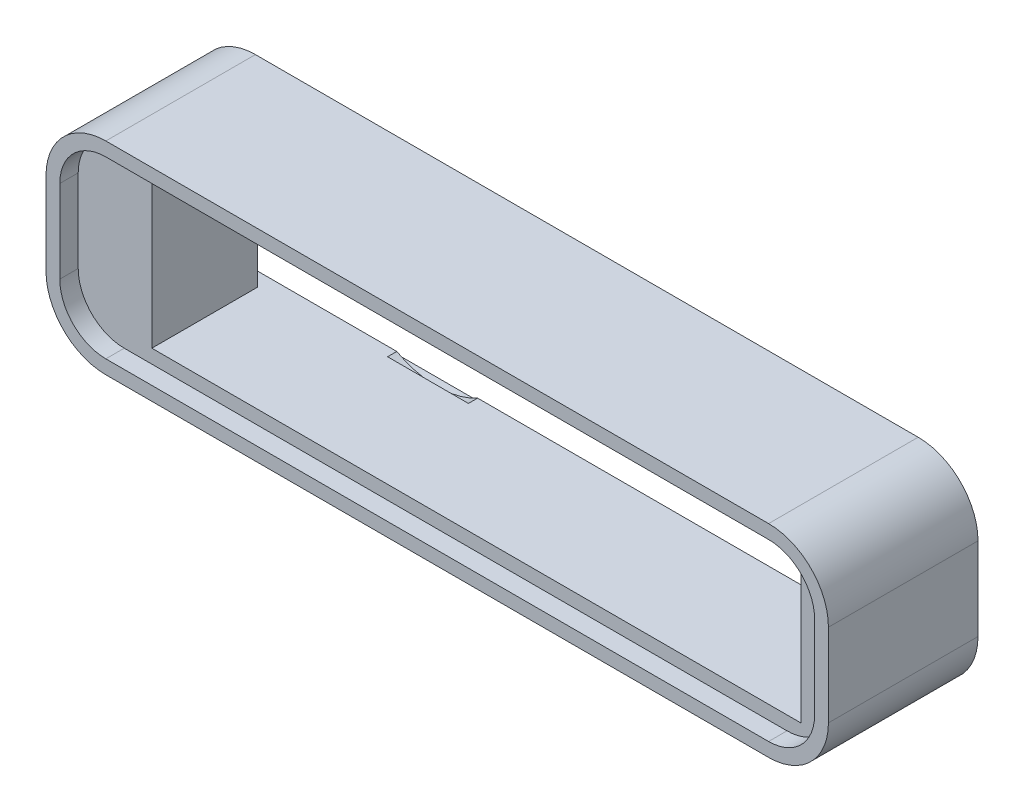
ISO-10303-21;
HEADER;
FILE_DESCRIPTION(('STEP AP214'),'2;1');
FILE_NAME('part.step','',(''),(''),'','','');
FILE_SCHEMA(('AUTOMOTIVE_DESIGN { 1 0 10303 214 1 1 1 1 }'));
ENDSEC;
DATA;
#1=APPLICATION_CONTEXT('core data for automotive mechanical design processes');
#2=APPLICATION_PROTOCOL_DEFINITION('international standard','automotive_design',2000,#1);
#3=PRODUCT_CONTEXT('',#1,'mechanical');
#4=PRODUCT('Part','Part','',(#3));
#5=PRODUCT_RELATED_PRODUCT_CATEGORY('part','',(#4));
#6=PRODUCT_DEFINITION_FORMATION('','',#4);
#7=PRODUCT_DEFINITION_CONTEXT('part definition',#1,'design');
#8=PRODUCT_DEFINITION('design','',#6,#7);
#9=PRODUCT_DEFINITION_SHAPE('','',#8);
#10=(LENGTH_UNIT() NAMED_UNIT(*) SI_UNIT(.MILLI.,.METRE.));
#11=(NAMED_UNIT(*) PLANE_ANGLE_UNIT() SI_UNIT($,.RADIAN.));
#12=(NAMED_UNIT(*) SI_UNIT($,.STERADIAN.) SOLID_ANGLE_UNIT());
#13=UNCERTAINTY_MEASURE_WITH_UNIT(LENGTH_MEASURE(1.E-05),#10,'distance_accuracy_value','');
#14=(GEOMETRIC_REPRESENTATION_CONTEXT(3) GLOBAL_UNCERTAINTY_ASSIGNED_CONTEXT((#13)) GLOBAL_UNIT_ASSIGNED_CONTEXT((#10,
#11,#12)) REPRESENTATION_CONTEXT('',''));
#15=CARTESIAN_POINT('',(0.,0.,0.));
#16=DIRECTION('',(0.,0.,1.));
#17=DIRECTION('',(1.,0.,0.));
#18=AXIS2_PLACEMENT_3D('',#15,#16,#17);
#19=CARTESIAN_POINT('',(-72.,-9.00000000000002,-21.));
#20=DIRECTION('',(0.,0.,-1.));
#21=DIRECTION('',(-1.,0.,0.));
#22=AXIS2_PLACEMENT_3D('',#19,#20,#21);
#23=PLANE('',#22);
#24=CARTESIAN_POINT('',(-30.,0.,-21.));
#25=DIRECTION('',(0.,0.,-1.));
#26=DIRECTION('',(-1.,0.,0.));
#27=AXIS2_PLACEMENT_3D('',#24,#25,#26);
#28=CIRCLE('',#27,18.25);
#29=CARTESIAN_POINT('',(-38.7785249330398,16.,-21.));
#30=VERTEX_POINT('',#29);
#31=CARTESIAN_POINT('',(-21.2214750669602,16.,-21.));
#32=VERTEX_POINT('',#31);
#33=EDGE_CURVE('E320',#30,#32,#28,.T.);
#34=ORIENTED_EDGE('',*,*,#33,.F.);
#35=DIRECTION('',(-1.,0.,0.));
#36=VECTOR('',#35,1.);
#37=CARTESIAN_POINT('',(66.,16.,-21.));
#38=LINE('',#37,#36);
#39=CARTESIAN_POINT('',(-66.,16.,-21.));
#40=VERTEX_POINT('',#39);
#41=EDGE_CURVE('E332',#30,#40,#38,.T.);
#42=ORIENTED_EDGE('',*,*,#41,.T.);
#43=DIRECTION('',(0.,-1.,0.));
#44=VECTOR('',#43,1.);
#45=CARTESIAN_POINT('',(-66.,16.,-21.));
#46=LINE('',#45,#44);
#47=CARTESIAN_POINT('',(-66.,-6.,-21.));
#48=VERTEX_POINT('',#47);
#49=EDGE_CURVE('E362',#40,#48,#46,.T.);
#50=ORIENTED_EDGE('',*,*,#49,.T.);
#51=DIRECTION('',(1.,0.,0.));
#52=VECTOR('',#51,1.);
#53=CARTESIAN_POINT('',(-85.001,-6.,-21.));
#54=LINE('',#53,#52);
#55=CARTESIAN_POINT('',(-69.,-6.,-21.));
#56=VERTEX_POINT('',#55);
#57=EDGE_CURVE('E544',#56,#48,#54,.T.);
#58=ORIENTED_EDGE('',*,*,#57,.F.);
#59=DIRECTION('',(0.,-1.,0.));
#60=VECTOR('',#59,1.);
#61=CARTESIAN_POINT('',(-69.,-16.5,-21.));
#62=LINE('',#61,#60);
#63=CARTESIAN_POINT('',(-69.,16.5,-21.));
#64=VERTEX_POINT('',#63);
#65=EDGE_CURVE('E639',#64,#56,#62,.T.);
#66=ORIENTED_EDGE('',*,*,#65,.F.);
#67=DIRECTION('',(1.,0.,0.));
#68=VECTOR('',#67,1.);
#69=CARTESIAN_POINT('',(-77.,16.5,-21.));
#70=LINE('',#69,#68);
#71=CARTESIAN_POINT('',(-77.,16.5,-21.));
#72=VERTEX_POINT('',#71);
#73=EDGE_CURVE('E630',#72,#64,#70,.T.);
#74=ORIENTED_EDGE('',*,*,#73,.F.);
#75=DIRECTION('',(0.,1.,0.));
#76=VECTOR('',#75,1.);
#77=CARTESIAN_POINT('',(-77.,-16.5,-21.));
#78=LINE('',#77,#76);
#79=CARTESIAN_POINT('',(-77.,-16.5,-21.));
#80=VERTEX_POINT('',#79);
#81=EDGE_CURVE('E633',#80,#72,#78,.T.);
#82=ORIENTED_EDGE('',*,*,#81,.F.);
#83=DIRECTION('',(-1.,0.,0.));
#84=VECTOR('',#83,1.);
#85=CARTESIAN_POINT('',(-77.,-16.5,-21.));
#86=LINE('',#85,#84);
#87=CARTESIAN_POINT('',(-69.,-16.5,-21.));
#88=VERTEX_POINT('',#87);
#89=EDGE_CURVE('E636',#88,#80,#86,.T.);
#90=ORIENTED_EDGE('',*,*,#89,.F.);
#91=CARTESIAN_POINT('',(-69.,-16.,-21.));
#92=VERTEX_POINT('',#91);
#93=EDGE_CURVE('E629',#92,#88,#62,.T.);
#94=ORIENTED_EDGE('',*,*,#93,.F.);
#95=DIRECTION('',(1.,0.,0.));
#96=VECTOR('',#95,1.);
#97=CARTESIAN_POINT('',(-66.,-16.,-21.));
#98=LINE('',#97,#96);
#99=CARTESIAN_POINT('',(-38.7785249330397,-16.,-21.));
#100=VERTEX_POINT('',#99);
#101=EDGE_CURVE('E346',#92,#100,#98,.T.);
#102=ORIENTED_EDGE('',*,*,#101,.T.);
#103=CARTESIAN_POINT('',(-21.2214750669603,-16.,-21.));
#104=VERTEX_POINT('',#103);
#105=EDGE_CURVE('E337',#104,#100,#28,.T.);
#106=ORIENTED_EDGE('',*,*,#105,.F.);
#107=CARTESIAN_POINT('',(75.,-16.,-21.));
#108=VERTEX_POINT('',#107);
#109=EDGE_CURVE('E475',#104,#108,#98,.T.);
#110=ORIENTED_EDGE('',*,*,#109,.T.);
#111=DIRECTION('',(0.,1.,0.));
#112=VECTOR('',#111,1.);
#113=CARTESIAN_POINT('',(75.,16.,-21.));
#114=LINE('',#113,#112);
#115=CARTESIAN_POINT('',(75.,16.,-21.));
#116=VERTEX_POINT('',#115);
#117=EDGE_CURVE('E343',#108,#116,#114,.T.);
#118=ORIENTED_EDGE('',*,*,#117,.T.);
#119=EDGE_CURVE('E336',#116,#32,#38,.T.);
#120=ORIENTED_EDGE('',*,*,#119,.T.);
#121=EDGE_LOOP('',(#34,#42,#50,#58,#66,#74,#82,#90,#94,#102,#106,#110,#118,#120));
#122=FACE_BOUND('',#121,.T.);
#123=CARTESIAN_POINT('',(-72.,9.00000000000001,-21.));
#124=DIRECTION('',(0.,0.,-1.));
#125=DIRECTION('',(-1.,0.,0.));
#126=AXIS2_PLACEMENT_3D('',#123,#124,#125);
#127=CIRCLE('',#126,9.99999999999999);
#128=CARTESIAN_POINT('',(-82.,9.00000000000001,-21.));
#129=VERTEX_POINT('',#128);
#130=CARTESIAN_POINT('',(-72.,19.,-21.));
#131=VERTEX_POINT('',#130);
#132=EDGE_CURVE('E551',#129,#131,#127,.T.);
#133=ORIENTED_EDGE('',*,*,#132,.T.);
#134=DIRECTION('',(1.,0.,0.));
#135=VECTOR('',#134,1.);
#136=CARTESIAN_POINT('',(-72.,19.,-21.));
#137=LINE('',#136,#135);
#138=CARTESIAN_POINT('',(72.,19.,-21.));
#139=VERTEX_POINT('',#138);
#140=EDGE_CURVE('E547',#131,#139,#137,.T.);
#141=ORIENTED_EDGE('',*,*,#140,.T.);
#142=CARTESIAN_POINT('',(72.,8.99999999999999,-21.));
#143=DIRECTION('',(0.,0.,-1.));
#144=DIRECTION('',(-1.,0.,0.));
#145=AXIS2_PLACEMENT_3D('',#142,#143,#144);
#146=CIRCLE('',#145,10.);
#147=CARTESIAN_POINT('',(82.,9.,-21.));
#148=VERTEX_POINT('',#147);
#149=EDGE_CURVE('E569',#139,#148,#146,.T.);
#150=ORIENTED_EDGE('',*,*,#149,.T.);
#151=DIRECTION('',(0.,-1.,0.));
#152=VECTOR('',#151,1.);
#153=CARTESIAN_POINT('',(82.,-9.00000000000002,-21.));
#154=LINE('',#153,#152);
#155=CARTESIAN_POINT('',(82.,-9.,-21.));
#156=VERTEX_POINT('',#155);
#157=EDGE_CURVE('E572',#148,#156,#154,.T.);
#158=ORIENTED_EDGE('',*,*,#157,.T.);
#159=CARTESIAN_POINT('',(72.,-9.,-21.));
#160=DIRECTION('',(0.,0.,-1.));
#161=DIRECTION('',(-1.,0.,0.));
#162=AXIS2_PLACEMENT_3D('',#159,#160,#161);
#163=CIRCLE('',#162,10.);
#164=CARTESIAN_POINT('',(72.,-19.,-21.));
#165=VERTEX_POINT('',#164);
#166=EDGE_CURVE('E575',#156,#165,#163,.T.);
#167=ORIENTED_EDGE('',*,*,#166,.T.);
#168=DIRECTION('',(-1.,0.,0.));
#169=VECTOR('',#168,1.);
#170=CARTESIAN_POINT('',(-72.,-19.,-21.));
#171=LINE('',#170,#169);
#172=CARTESIAN_POINT('',(-72.,-19.,-21.));
#173=VERTEX_POINT('',#172);
#174=EDGE_CURVE('E578',#165,#173,#171,.T.);
#175=ORIENTED_EDGE('',*,*,#174,.T.);
#176=CARTESIAN_POINT('',(-72.,-9.00000000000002,-21.));
#177=DIRECTION('',(0.,0.,-1.));
#178=DIRECTION('',(-1.,0.,0.));
#179=AXIS2_PLACEMENT_3D('',#176,#177,#178);
#180=CIRCLE('',#179,9.99999999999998);
#181=CARTESIAN_POINT('',(-82.,-9.00000000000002,-21.));
#182=VERTEX_POINT('',#181);
#183=EDGE_CURVE('E581',#173,#182,#180,.T.);
#184=ORIENTED_EDGE('',*,*,#183,.T.);
#185=DIRECTION('',(0.,1.,0.));
#186=VECTOR('',#185,1.);
#187=CARTESIAN_POINT('',(-82.,-9.00000000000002,-21.));
#188=LINE('',#187,#186);
#189=EDGE_CURVE('E584',#182,#129,#188,.T.);
#190=ORIENTED_EDGE('',*,*,#189,.T.);
#191=EDGE_LOOP('',(#133,#141,#150,#158,#167,#175,#184,#190));
#192=FACE_BOUND('',#191,.T.);
#193=ADVANCED_FACE('F37',(#122,#192),#23,.T.);
#194=CARTESIAN_POINT('',(-72.,9.00000000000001,5.));
#195=DIRECTION('',(0.,0.,-1.));
#196=DIRECTION('',(-1.,0.,0.));
#197=AXIS2_PLACEMENT_3D('',#194,#195,#196);
#198=CYLINDRICAL_SURFACE('',#197,13.);
#199=DIRECTION('',(0.,0.,-1.));
#200=VECTOR('',#199,1.);
#201=CARTESIAN_POINT('',(-72.,22.,5.));
#202=LINE('',#201,#200);
#203=CARTESIAN_POINT('',(-72.,22.,9.));
#204=VERTEX_POINT('',#203);
#205=CARTESIAN_POINT('',(-72.,22.,-23.5));
#206=VERTEX_POINT('',#205);
#207=EDGE_CURVE('E450',#204,#206,#202,.T.);
#208=ORIENTED_EDGE('',*,*,#207,.T.);
#209=CARTESIAN_POINT('',(-72.,9.00000000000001,-23.5));
#210=DIRECTION('',(0.,0.,-1.));
#211=DIRECTION('',(-1.,0.,0.));
#212=AXIS2_PLACEMENT_3D('',#209,#210,#211);
#213=CIRCLE('',#212,13.);
#214=CARTESIAN_POINT('',(-85.,9.00000000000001,-23.5));
#215=VERTEX_POINT('',#214);
#216=EDGE_CURVE('E617',#215,#206,#213,.T.);
#217=ORIENTED_EDGE('',*,*,#216,.F.);
#218=DIRECTION('',(0.,0.,-1.));
#219=VECTOR('',#218,1.);
#220=CARTESIAN_POINT('',(-85.,9.00000000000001,5.));
#221=LINE('',#220,#219);
#222=CARTESIAN_POINT('',(-85.,9.00000000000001,9.));
#223=VERTEX_POINT('',#222);
#224=EDGE_CURVE('E466',#223,#215,#221,.T.);
#225=ORIENTED_EDGE('',*,*,#224,.F.);
#226=CARTESIAN_POINT('',(-72.,9.00000000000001,9.));
#227=DIRECTION('',(0.,0.,1.));
#228=DIRECTION('',(1.,0.,0.));
#229=AXIS2_PLACEMENT_3D('',#226,#227,#228);
#230=CIRCLE('',#229,13.);
#231=EDGE_CURVE('E426',#204,#223,#230,.T.);
#232=ORIENTED_EDGE('',*,*,#231,.F.);
#233=EDGE_LOOP('',(#208,#217,#225,#232));
#234=FACE_BOUND('',#233,.T.);
#235=ADVANCED_FACE('F39',(#234),#198,.T.);
#236=CARTESIAN_POINT('',(-85.,-9.00000000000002,5.));
#237=DIRECTION('',(1.,0.,0.));
#238=DIRECTION('',(0.,0.,-1.));
#239=AXIS2_PLACEMENT_3D('',#236,#237,#238);
#240=PLANE('',#239);
#241=ORIENTED_EDGE('',*,*,#224,.T.);
#242=DIRECTION('',(0.,1.,0.));
#243=VECTOR('',#242,1.);
#244=CARTESIAN_POINT('',(-85.,-9.00000000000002,-23.5));
#245=LINE('',#244,#243);
#246=CARTESIAN_POINT('',(-85.,-9.00000000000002,-23.5));
#247=VERTEX_POINT('',#246);
#248=EDGE_CURVE('E614',#247,#215,#245,.T.);
#249=ORIENTED_EDGE('',*,*,#248,.F.);
#250=DIRECTION('',(0.,0.,-1.));
#251=VECTOR('',#250,1.);
#252=CARTESIAN_POINT('',(-85.,-9.00000000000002,5.));
#253=LINE('',#252,#251);
#254=CARTESIAN_POINT('',(-85.,-9.00000000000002,9.));
#255=VERTEX_POINT('',#254);
#256=EDGE_CURVE('E464',#255,#247,#253,.T.);
#257=ORIENTED_EDGE('',*,*,#256,.F.);
#258=DIRECTION('',(0.,-1.,0.));
#259=VECTOR('',#258,1.);
#260=CARTESIAN_POINT('',(-85.,9.00000000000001,9.));
#261=LINE('',#260,#259);
#262=EDGE_CURVE('E429',#223,#255,#261,.T.);
#263=ORIENTED_EDGE('',*,*,#262,.F.);
#264=EDGE_LOOP('',(#241,#249,#257,#263));
#265=FACE_BOUND('',#264,.T.);
#266=ADVANCED_FACE('F720',(#265),#240,.F.);
#267=CARTESIAN_POINT('',(-72.,-9.00000000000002,5.));
#268=DIRECTION('',(0.,0.,-1.));
#269=DIRECTION('',(-1.,0.,0.));
#270=AXIS2_PLACEMENT_3D('',#267,#268,#269);
#271=CYLINDRICAL_SURFACE('',#270,13.);
#272=DIRECTION('',(0.,0.,-1.));
#273=VECTOR('',#272,1.);
#274=CARTESIAN_POINT('',(-75.5,-21.5199840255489,5.));
#275=LINE('',#274,#273);
#276=CARTESIAN_POINT('',(-75.5,-21.5199840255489,0.999999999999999));
#277=VERTEX_POINT('',#276);
#278=CARTESIAN_POINT('',(-75.5,-21.5199840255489,-19.));
#279=VERTEX_POINT('',#278);
#280=EDGE_CURVE('E496',#277,#279,#275,.T.);
#281=ORIENTED_EDGE('',*,*,#280,.F.);
#282=CARTESIAN_POINT('',(-72.,-9.00000000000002,0.999999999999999));
#283=DIRECTION('',(0.,0.,1.));
#284=DIRECTION('',(1.,0.,0.));
#285=AXIS2_PLACEMENT_3D('',#282,#283,#284);
#286=CIRCLE('',#285,13.);
#287=CARTESIAN_POINT('',(-72.,-22.,0.999999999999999));
#288=VERTEX_POINT('',#287);
#289=EDGE_CURVE('E499',#288,#277,#286,.F.);
#290=ORIENTED_EDGE('',*,*,#289,.F.);
#291=DIRECTION('',(0.,0.,-1.));
#292=VECTOR('',#291,1.);
#293=CARTESIAN_POINT('',(-72.,-22.,5.));
#294=LINE('',#293,#292);
#295=CARTESIAN_POINT('',(-72.,-22.,9.));
#296=VERTEX_POINT('',#295);
#297=EDGE_CURVE('E461',#296,#288,#294,.T.);
#298=ORIENTED_EDGE('',*,*,#297,.F.);
#299=CARTESIAN_POINT('',(-72.,-9.00000000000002,9.));
#300=DIRECTION('',(0.,0.,1.));
#301=DIRECTION('',(1.,0.,0.));
#302=AXIS2_PLACEMENT_3D('',#299,#300,#301);
#303=CIRCLE('',#302,13.);
#304=EDGE_CURVE('E432',#255,#296,#303,.T.);
#305=ORIENTED_EDGE('',*,*,#304,.F.);
#306=ORIENTED_EDGE('',*,*,#256,.T.);
#307=CARTESIAN_POINT('',(-72.,-9.00000000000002,-23.5));
#308=DIRECTION('',(0.,0.,-1.));
#309=DIRECTION('',(-1.,0.,0.));
#310=AXIS2_PLACEMENT_3D('',#307,#308,#309);
#311=CIRCLE('',#310,13.);
#312=CARTESIAN_POINT('',(-72.,-22.,-23.5));
#313=VERTEX_POINT('',#312);
#314=EDGE_CURVE('E611',#313,#247,#311,.T.);
#315=ORIENTED_EDGE('',*,*,#314,.F.);
#316=CARTESIAN_POINT('',(-72.,-22.,-19.));
#317=VERTEX_POINT('',#316);
#318=EDGE_CURVE('E460',#317,#313,#294,.T.);
#319=ORIENTED_EDGE('',*,*,#318,.F.);
#320=CARTESIAN_POINT('',(-72.,-9.00000000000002,-19.));
#321=DIRECTION('',(0.,0.,-1.));
#322=DIRECTION('',(-1.,0.,0.));
#323=AXIS2_PLACEMENT_3D('',#320,#321,#322);
#324=CIRCLE('',#323,13.);
#325=EDGE_CURVE('E525',#279,#317,#324,.F.);
#326=ORIENTED_EDGE('',*,*,#325,.F.);
#327=EDGE_LOOP('',(#281,#290,#298,#305,#306,#315,#319,#326));
#328=FACE_BOUND('',#327,.T.);
#329=ADVANCED_FACE('F782',(#328),#271,.T.);
#330=CARTESIAN_POINT('',(-72.,-22.,5.));
#331=DIRECTION('',(0.,1.,0.));
#332=DIRECTION('',(0.,0.,1.));
#333=AXIS2_PLACEMENT_3D('',#330,#331,#332);
#334=PLANE('',#333);
#335=CARTESIAN_POINT('',(-60.,-22.,0.));
#336=DIRECTION('',(0.,-1.,0.));
#337=DIRECTION('',(0.,0.,-1.));
#338=AXIS2_PLACEMENT_3D('',#335,#336,#337);
#339=CIRCLE('',#338,4.75);
#340=CARTESIAN_POINT('',(-60.,-22.,-4.75));
#341=VERTEX_POINT('',#340);
#342=EDGE_CURVE('E484',#341,#341,#339,.T.);
#343=ORIENTED_EDGE('',*,*,#342,.F.);
#344=EDGE_LOOP('',(#343));
#345=FACE_BOUND('',#344,.T.);
#346=CARTESIAN_POINT('',(60.,-22.,0.));
#347=DIRECTION('',(0.,-1.,0.));
#348=DIRECTION('',(0.,0.,-1.));
#349=AXIS2_PLACEMENT_3D('',#346,#347,#348);
#350=CIRCLE('',#349,4.75);
#351=CARTESIAN_POINT('',(60.,-22.,-4.75));
#352=VERTEX_POINT('',#351);
#353=EDGE_CURVE('E1187',#352,#352,#350,.T.);
#354=ORIENTED_EDGE('',*,*,#353,.F.);
#355=EDGE_LOOP('',(#354));
#356=FACE_BOUND('',#355,.T.);
#357=CARTESIAN_POINT('',(0.,-22.,-14.5));
#358=DIRECTION('',(0.,-1.,0.));
#359=DIRECTION('',(0.,0.,-1.));
#360=AXIS2_PLACEMENT_3D('',#357,#358,#359);
#361=CIRCLE('',#360,4.75);
#362=CARTESIAN_POINT('',(0.,-22.,-19.25));
#363=VERTEX_POINT('',#362);
#364=EDGE_CURVE('E1194',#363,#363,#361,.T.);
#365=ORIENTED_EDGE('',*,*,#364,.F.);
#366=EDGE_LOOP('',(#365));
#367=FACE_BOUND('',#366,.T.);
#368=ORIENTED_EDGE('',*,*,#297,.T.);
#369=DIRECTION('',(-1.,0.,0.));
#370=VECTOR('',#369,1.);
#371=CARTESIAN_POINT('',(-75.5,-22.,0.999999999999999));
#372=LINE('',#371,#370);
#373=CARTESIAN_POINT('',(-70.5,-22.,0.999999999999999));
#374=VERTEX_POINT('',#373);
#375=EDGE_CURVE('E494',#374,#288,#372,.T.);
#376=ORIENTED_EDGE('',*,*,#375,.F.);
#377=DIRECTION('',(0.,0.,1.));
#378=VECTOR('',#377,1.);
#379=CARTESIAN_POINT('',(-70.5,-22.,-19.));
#380=LINE('',#379,#378);
#381=CARTESIAN_POINT('',(-70.5,-22.,-19.));
#382=VERTEX_POINT('',#381);
#383=EDGE_CURVE('E491',#382,#374,#380,.T.);
#384=ORIENTED_EDGE('',*,*,#383,.F.);
#385=DIRECTION('',(1.,0.,0.));
#386=VECTOR('',#385,1.);
#387=CARTESIAN_POINT('',(-75.5,-22.,-19.));
#388=LINE('',#387,#386);
#389=EDGE_CURVE('E516',#317,#382,#388,.T.);
#390=ORIENTED_EDGE('',*,*,#389,.F.);
#391=ORIENTED_EDGE('',*,*,#318,.T.);
#392=DIRECTION('',(-1.,0.,0.));
#393=VECTOR('',#392,1.);
#394=CARTESIAN_POINT('',(-72.,-22.,-23.5));
#395=LINE('',#394,#393);
#396=CARTESIAN_POINT('',(72.,-22.,-23.5));
#397=VERTEX_POINT('',#396);
#398=EDGE_CURVE('E608',#397,#313,#395,.T.);
#399=ORIENTED_EDGE('',*,*,#398,.F.);
#400=DIRECTION('',(0.,0.,-1.));
#401=VECTOR('',#400,1.);
#402=CARTESIAN_POINT('',(72.,-22.,5.));
#403=LINE('',#402,#401);
#404=CARTESIAN_POINT('',(72.,-22.,9.));
#405=VERTEX_POINT('',#404);
#406=EDGE_CURVE('E458',#405,#397,#403,.T.);
#407=ORIENTED_EDGE('',*,*,#406,.F.);
#408=DIRECTION('',(1.,0.,0.));
#409=VECTOR('',#408,1.);
#410=CARTESIAN_POINT('',(-72.,-22.,9.));
#411=LINE('',#410,#409);
#412=EDGE_CURVE('E435',#296,#405,#411,.T.);
#413=ORIENTED_EDGE('',*,*,#412,.F.);
#414=EDGE_LOOP('',(#368,#376,#384,#390,#391,#399,#407,#413));
#415=FACE_BOUND('',#414,.T.);
#416=ADVANCED_FACE('F778',(#345,#356,#367,#415),#334,.F.);
#417=CARTESIAN_POINT('',(72.,-9.,5.));
#418=DIRECTION('',(0.,0.,-1.));
#419=DIRECTION('',(-1.,0.,0.));
#420=AXIS2_PLACEMENT_3D('',#417,#418,#419);
#421=CYLINDRICAL_SURFACE('',#420,13.);
#422=ORIENTED_EDGE('',*,*,#406,.T.);
#423=CARTESIAN_POINT('',(72.,-9.,-23.5));
#424=DIRECTION('',(0.,0.,-1.));
#425=DIRECTION('',(-1.,0.,0.));
#426=AXIS2_PLACEMENT_3D('',#423,#424,#425);
#427=CIRCLE('',#426,13.);
#428=CARTESIAN_POINT('',(85.,-8.99999999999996,-23.5));
#429=VERTEX_POINT('',#428);
#430=EDGE_CURVE('E605',#429,#397,#427,.T.);
#431=ORIENTED_EDGE('',*,*,#430,.F.);
#432=DIRECTION('',(0.,0.,-1.));
#433=VECTOR('',#432,1.);
#434=CARTESIAN_POINT('',(85.,-8.99999999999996,5.));
#435=LINE('',#434,#433);
#436=CARTESIAN_POINT('',(85.,-8.99999999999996,9.));
#437=VERTEX_POINT('',#436);
#438=EDGE_CURVE('E456',#437,#429,#435,.T.);
#439=ORIENTED_EDGE('',*,*,#438,.F.);
#440=CARTESIAN_POINT('',(72.,-9.,9.));
#441=DIRECTION('',(0.,0.,1.));
#442=DIRECTION('',(1.,0.,0.));
#443=AXIS2_PLACEMENT_3D('',#440,#441,#442);
#444=CIRCLE('',#443,13.);
#445=EDGE_CURVE('E438',#405,#437,#444,.T.);
#446=ORIENTED_EDGE('',*,*,#445,.F.);
#447=EDGE_LOOP('',(#422,#431,#439,#446));
#448=FACE_BOUND('',#447,.T.);
#449=ADVANCED_FACE('F774',(#448),#421,.T.);
#450=CARTESIAN_POINT('',(85.,-8.99999999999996,5.));
#451=DIRECTION('',(-1.,0.,0.));
#452=DIRECTION('',(0.,0.,1.));
#453=AXIS2_PLACEMENT_3D('',#450,#451,#452);
#454=PLANE('',#453);
#455=ORIENTED_EDGE('',*,*,#438,.T.);
#456=DIRECTION('',(0.,-1.,0.));
#457=VECTOR('',#456,1.);
#458=CARTESIAN_POINT('',(85.,-9.00000000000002,-23.5));
#459=LINE('',#458,#457);
#460=CARTESIAN_POINT('',(85.,8.99999999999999,-23.5));
#461=VERTEX_POINT('',#460);
#462=EDGE_CURVE('E626',#461,#429,#459,.T.);
#463=ORIENTED_EDGE('',*,*,#462,.F.);
#464=DIRECTION('',(0.,0.,-1.));
#465=VECTOR('',#464,1.);
#466=CARTESIAN_POINT('',(85.,8.99999999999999,5.));
#467=LINE('',#466,#465);
#468=CARTESIAN_POINT('',(85.,8.99999999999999,9.));
#469=VERTEX_POINT('',#468);
#470=EDGE_CURVE('E454',#469,#461,#467,.T.);
#471=ORIENTED_EDGE('',*,*,#470,.F.);
#472=DIRECTION('',(0.,1.,0.));
#473=VECTOR('',#472,1.);
#474=CARTESIAN_POINT('',(85.,-8.99999999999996,9.));
#475=LINE('',#474,#473);
#476=EDGE_CURVE('E441',#437,#469,#475,.T.);
#477=ORIENTED_EDGE('',*,*,#476,.F.);
#478=EDGE_LOOP('',(#455,#463,#471,#477));
#479=FACE_BOUND('',#478,.T.);
#480=ADVANCED_FACE('F770',(#479),#454,.F.);
#481=CARTESIAN_POINT('',(72.,8.99999999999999,5.));
#482=DIRECTION('',(0.,0.,-1.));
#483=DIRECTION('',(-1.,0.,0.));
#484=AXIS2_PLACEMENT_3D('',#481,#482,#483);
#485=CYLINDRICAL_SURFACE('',#484,13.);
#486=ORIENTED_EDGE('',*,*,#470,.T.);
#487=CARTESIAN_POINT('',(72.,8.99999999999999,-23.5));
#488=DIRECTION('',(0.,0.,-1.));
#489=DIRECTION('',(-1.,0.,0.));
#490=AXIS2_PLACEMENT_3D('',#487,#488,#489);
#491=CIRCLE('',#490,13.);
#492=CARTESIAN_POINT('',(72.,22.,-23.5));
#493=VERTEX_POINT('',#492);
#494=EDGE_CURVE('E623',#493,#461,#491,.T.);
#495=ORIENTED_EDGE('',*,*,#494,.F.);
#496=DIRECTION('',(0.,0.,-1.));
#497=VECTOR('',#496,1.);
#498=CARTESIAN_POINT('',(72.,22.,5.));
#499=LINE('',#498,#497);
#500=CARTESIAN_POINT('',(72.,22.,9.));
#501=VERTEX_POINT('',#500);
#502=EDGE_CURVE('E452',#501,#493,#499,.T.);
#503=ORIENTED_EDGE('',*,*,#502,.F.);
#504=CARTESIAN_POINT('',(72.,8.99999999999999,9.));
#505=DIRECTION('',(0.,0.,1.));
#506=DIRECTION('',(1.,0.,0.));
#507=AXIS2_PLACEMENT_3D('',#504,#505,#506);
#508=CIRCLE('',#507,13.);
#509=EDGE_CURVE('E444',#469,#501,#508,.T.);
#510=ORIENTED_EDGE('',*,*,#509,.F.);
#511=EDGE_LOOP('',(#486,#495,#503,#510));
#512=FACE_BOUND('',#511,.T.);
#513=ADVANCED_FACE('F766',(#512),#485,.T.);
#514=CARTESIAN_POINT('',(-72.,22.,5.));
#515=DIRECTION('',(0.,-1.,0.));
#516=DIRECTION('',(0.,0.,-1.));
#517=AXIS2_PLACEMENT_3D('',#514,#515,#516);
#518=PLANE('',#517);
#519=ORIENTED_EDGE('',*,*,#502,.T.);
#520=DIRECTION('',(1.,0.,0.));
#521=VECTOR('',#520,1.);
#522=CARTESIAN_POINT('',(-72.,22.,-23.5));
#523=LINE('',#522,#521);
#524=EDGE_CURVE('E620',#206,#493,#523,.T.);
#525=ORIENTED_EDGE('',*,*,#524,.F.);
#526=ORIENTED_EDGE('',*,*,#207,.F.);
#527=DIRECTION('',(-1.,0.,0.));
#528=VECTOR('',#527,1.);
#529=CARTESIAN_POINT('',(-72.,22.,9.));
#530=LINE('',#529,#528);
#531=EDGE_CURVE('E447',#501,#204,#530,.T.);
#532=ORIENTED_EDGE('',*,*,#531,.F.);
#533=EDGE_LOOP('',(#519,#525,#526,#532));
#534=FACE_BOUND('',#533,.T.);
#535=ADVANCED_FACE('F760',(#534),#518,.F.);
#536=CARTESIAN_POINT('',(-72.,9.00000000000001,9.));
#537=DIRECTION('',(0.,0.,1.));
#538=DIRECTION('',(1.,0.,0.));
#539=AXIS2_PLACEMENT_3D('',#536,#537,#538);
#540=PLANE('',#539);
#541=ORIENTED_EDGE('',*,*,#231,.T.);
#542=ORIENTED_EDGE('',*,*,#262,.T.);
#543=ORIENTED_EDGE('',*,*,#304,.T.);
#544=ORIENTED_EDGE('',*,*,#412,.T.);
#545=ORIENTED_EDGE('',*,*,#445,.T.);
#546=ORIENTED_EDGE('',*,*,#476,.T.);
#547=ORIENTED_EDGE('',*,*,#509,.T.);
#548=ORIENTED_EDGE('',*,*,#531,.T.);
#549=EDGE_LOOP('',(#541,#542,#543,#544,#545,#546,#547,#548));
#550=FACE_BOUND('',#549,.T.);
#551=DIRECTION('',(1.,0.,0.));
#552=VECTOR('',#551,1.);
#553=CARTESIAN_POINT('',(-72.,-19.,9.));
#554=LINE('',#553,#552);
#555=CARTESIAN_POINT('',(-72.,-19.,9.));
#556=VERTEX_POINT('',#555);
#557=CARTESIAN_POINT('',(72.,-19.,9.));
#558=VERTEX_POINT('',#557);
#559=EDGE_CURVE('E372',#556,#558,#554,.T.);
#560=ORIENTED_EDGE('',*,*,#559,.F.);
#561=CARTESIAN_POINT('',(-72.,-9.00000000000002,9.));
#562=DIRECTION('',(0.,0.,1.));
#563=DIRECTION('',(1.,0.,0.));
#564=AXIS2_PLACEMENT_3D('',#561,#562,#563);
#565=CIRCLE('',#564,9.99999999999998);
#566=CARTESIAN_POINT('',(-82.,-9.00000000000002,9.));
#567=VERTEX_POINT('',#566);
#568=EDGE_CURVE('E370',#567,#556,#565,.T.);
#569=ORIENTED_EDGE('',*,*,#568,.F.);
#570=DIRECTION('',(0.,-1.,0.));
#571=VECTOR('',#570,1.);
#572=CARTESIAN_POINT('',(-82.,9.00000000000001,9.));
#573=LINE('',#572,#571);
#574=CARTESIAN_POINT('',(-82.,9.00000000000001,9.));
#575=VERTEX_POINT('',#574);
#576=EDGE_CURVE('E386',#575,#567,#573,.T.);
#577=ORIENTED_EDGE('',*,*,#576,.F.);
#578=CARTESIAN_POINT('',(-72.,9.00000000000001,9.));
#579=DIRECTION('',(0.,0.,1.));
#580=DIRECTION('',(1.,0.,0.));
#581=AXIS2_PLACEMENT_3D('',#578,#579,#580);
#582=CIRCLE('',#581,9.99999999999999);
#583=CARTESIAN_POINT('',(-72.,19.,9.));
#584=VERTEX_POINT('',#583);
#585=EDGE_CURVE('E383',#584,#575,#582,.T.);
#586=ORIENTED_EDGE('',*,*,#585,.F.);
#587=DIRECTION('',(-1.,0.,0.));
#588=VECTOR('',#587,1.);
#589=CARTESIAN_POINT('',(-72.,19.,9.));
#590=LINE('',#589,#588);
#591=CARTESIAN_POINT('',(72.,19.,9.));
#592=VERTEX_POINT('',#591);
#593=EDGE_CURVE('E381',#592,#584,#590,.T.);
#594=ORIENTED_EDGE('',*,*,#593,.F.);
#595=CARTESIAN_POINT('',(72.,8.99999999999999,9.));
#596=DIRECTION('',(0.,0.,1.));
#597=DIRECTION('',(1.,0.,0.));
#598=AXIS2_PLACEMENT_3D('',#595,#596,#597);
#599=CIRCLE('',#598,10.);
#600=CARTESIAN_POINT('',(82.,8.99999999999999,9.));
#601=VERTEX_POINT('',#600);
#602=EDGE_CURVE('E379',#601,#592,#599,.T.);
#603=ORIENTED_EDGE('',*,*,#602,.F.);
#604=DIRECTION('',(0.,1.,0.));
#605=VECTOR('',#604,1.);
#606=CARTESIAN_POINT('',(82.,-8.99999999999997,9.));
#607=LINE('',#606,#605);
#608=CARTESIAN_POINT('',(82.,-9.,9.));
#609=VERTEX_POINT('',#608);
#610=EDGE_CURVE('E377',#609,#601,#607,.T.);
#611=ORIENTED_EDGE('',*,*,#610,.F.);
#612=CARTESIAN_POINT('',(72.,-9.,9.));
#613=DIRECTION('',(0.,0.,1.));
#614=DIRECTION('',(1.,0.,0.));
#615=AXIS2_PLACEMENT_3D('',#612,#613,#614);
#616=CIRCLE('',#615,10.);
#617=EDGE_CURVE('E375',#558,#609,#616,.T.);
#618=ORIENTED_EDGE('',*,*,#617,.F.);
#619=EDGE_LOOP('',(#560,#569,#577,#586,#594,#603,#611,#618));
#620=FACE_BOUND('',#619,.T.);
#621=ADVANCED_FACE('F756',(#550,#620),#540,.T.);
#622=CARTESIAN_POINT('',(-72.,-9.00000000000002,9.));
#623=DIRECTION('',(0.,0.,-1.));
#624=DIRECTION('',(-1.,0.,0.));
#625=AXIS2_PLACEMENT_3D('',#622,#623,#624);
#626=CYLINDRICAL_SURFACE('',#625,9.99999999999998);
#627=CARTESIAN_POINT('',(-72.,-9.00000000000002,5.));
#628=DIRECTION('',(0.,0.,1.));
#629=DIRECTION('',(1.,0.,0.));
#630=AXIS2_PLACEMENT_3D('',#627,#628,#629);
#631=CIRCLE('',#630,9.99999999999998);
#632=CARTESIAN_POINT('',(-82.,-9.00000000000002,5.));
#633=VERTEX_POINT('',#632);
#634=CARTESIAN_POINT('',(-72.,-19.,5.));
#635=VERTEX_POINT('',#634);
#636=EDGE_CURVE('E364',#633,#635,#631,.T.);
#637=ORIENTED_EDGE('',*,*,#636,.F.);
#638=DIRECTION('',(0.,0.,-1.));
#639=VECTOR('',#638,1.);
#640=CARTESIAN_POINT('',(-82.,-9.00000000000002,9.));
#641=LINE('',#640,#639);
#642=EDGE_CURVE('E388',#567,#633,#641,.T.);
#643=ORIENTED_EDGE('',*,*,#642,.F.);
#644=ORIENTED_EDGE('',*,*,#568,.T.);
#645=DIRECTION('',(0.,0.,-1.));
#646=VECTOR('',#645,1.);
#647=CARTESIAN_POINT('',(-72.,-19.,9.));
#648=LINE('',#647,#646);
#649=EDGE_CURVE('E423',#556,#635,#648,.T.);
#650=ORIENTED_EDGE('',*,*,#649,.T.);
#651=EDGE_LOOP('',(#637,#643,#644,#650));
#652=FACE_BOUND('',#651,.T.);
#653=ADVANCED_FACE('F752',(#652),#626,.F.);
#654=CARTESIAN_POINT('',(-72.,-19.,9.));
#655=DIRECTION('',(0.,1.,0.));
#656=DIRECTION('',(0.,0.,1.));
#657=AXIS2_PLACEMENT_3D('',#654,#655,#656);
#658=PLANE('',#657);
#659=DIRECTION('',(1.,0.,0.));
#660=VECTOR('',#659,1.);
#661=CARTESIAN_POINT('',(-72.,-19.,5.));
#662=LINE('',#661,#660);
#663=CARTESIAN_POINT('',(72.,-19.,5.));
#664=VERTEX_POINT('',#663);
#665=EDGE_CURVE('E390',#635,#664,#662,.T.);
#666=ORIENTED_EDGE('',*,*,#665,.F.);
#667=ORIENTED_EDGE('',*,*,#649,.F.);
#668=ORIENTED_EDGE('',*,*,#559,.T.);
#669=DIRECTION('',(0.,0.,-1.));
#670=VECTOR('',#669,1.);
#671=CARTESIAN_POINT('',(72.,-19.,9.));
#672=LINE('',#671,#670);
#673=EDGE_CURVE('E420',#558,#664,#672,.T.);
#674=ORIENTED_EDGE('',*,*,#673,.T.);
#675=EDGE_LOOP('',(#666,#667,#668,#674));
#676=FACE_BOUND('',#675,.T.);
#677=ADVANCED_FACE('F748',(#676),#658,.T.);
#678=CARTESIAN_POINT('',(72.,-9.,9.));
#679=DIRECTION('',(0.,0.,-1.));
#680=DIRECTION('',(-1.,0.,0.));
#681=AXIS2_PLACEMENT_3D('',#678,#679,#680);
#682=CYLINDRICAL_SURFACE('',#681,10.);
#683=CARTESIAN_POINT('',(72.,-9.,5.));
#684=DIRECTION('',(0.,0.,1.));
#685=DIRECTION('',(1.,0.,0.));
#686=AXIS2_PLACEMENT_3D('',#683,#684,#685);
#687=CIRCLE('',#686,10.);
#688=CARTESIAN_POINT('',(82.,-9.,5.));
#689=VERTEX_POINT('',#688);
#690=EDGE_CURVE('E392',#664,#689,#687,.T.);
#691=ORIENTED_EDGE('',*,*,#690,.F.);
#692=ORIENTED_EDGE('',*,*,#673,.F.);
#693=ORIENTED_EDGE('',*,*,#617,.T.);
#694=DIRECTION('',(0.,0.,-1.));
#695=VECTOR('',#694,1.);
#696=CARTESIAN_POINT('',(82.,-9.,9.));
#697=LINE('',#696,#695);
#698=EDGE_CURVE('E417',#609,#689,#697,.T.);
#699=ORIENTED_EDGE('',*,*,#698,.T.);
#700=EDGE_LOOP('',(#691,#692,#693,#699));
#701=FACE_BOUND('',#700,.T.);
#702=ADVANCED_FACE('F744',(#701),#682,.F.);
#703=CARTESIAN_POINT('',(82.,-8.99999999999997,9.));
#704=DIRECTION('',(-1.,0.,0.));
#705=DIRECTION('',(0.,0.,1.));
#706=AXIS2_PLACEMENT_3D('',#703,#704,#705);
#707=PLANE('',#706);
#708=DIRECTION('',(0.,1.,0.));
#709=VECTOR('',#708,1.);
#710=CARTESIAN_POINT('',(82.,-8.99999999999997,5.));
#711=LINE('',#710,#709);
#712=CARTESIAN_POINT('',(82.,8.99999999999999,5.));
#713=VERTEX_POINT('',#712);
#714=EDGE_CURVE('E394',#689,#713,#711,.T.);
#715=ORIENTED_EDGE('',*,*,#714,.F.);
#716=ORIENTED_EDGE('',*,*,#698,.F.);
#717=ORIENTED_EDGE('',*,*,#610,.T.);
#718=DIRECTION('',(0.,0.,-1.));
#719=VECTOR('',#718,1.);
#720=CARTESIAN_POINT('',(82.,8.99999999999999,9.));
#721=LINE('',#720,#719);
#722=EDGE_CURVE('E414',#601,#713,#721,.T.);
#723=ORIENTED_EDGE('',*,*,#722,.T.);
#724=EDGE_LOOP('',(#715,#716,#717,#723));
#725=FACE_BOUND('',#724,.T.);
#726=ADVANCED_FACE('F740',(#725),#707,.T.);
#727=CARTESIAN_POINT('',(72.,8.99999999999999,9.));
#728=DIRECTION('',(0.,0.,-1.));
#729=DIRECTION('',(-1.,0.,0.));
#730=AXIS2_PLACEMENT_3D('',#727,#728,#729);
#731=CYLINDRICAL_SURFACE('',#730,10.);
#732=CARTESIAN_POINT('',(72.,8.99999999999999,5.));
#733=DIRECTION('',(0.,0.,1.));
#734=DIRECTION('',(1.,0.,0.));
#735=AXIS2_PLACEMENT_3D('',#732,#733,#734);
#736=CIRCLE('',#735,10.);
#737=CARTESIAN_POINT('',(72.,19.,5.));
#738=VERTEX_POINT('',#737);
#739=EDGE_CURVE('E396',#713,#738,#736,.T.);
#740=ORIENTED_EDGE('',*,*,#739,.F.);
#741=ORIENTED_EDGE('',*,*,#722,.F.);
#742=ORIENTED_EDGE('',*,*,#602,.T.);
#743=DIRECTION('',(0.,0.,-1.));
#744=VECTOR('',#743,1.);
#745=CARTESIAN_POINT('',(72.,19.,9.));
#746=LINE('',#745,#744);
#747=EDGE_CURVE('E411',#592,#738,#746,.T.);
#748=ORIENTED_EDGE('',*,*,#747,.T.);
#749=EDGE_LOOP('',(#740,#741,#742,#748));
#750=FACE_BOUND('',#749,.T.);
#751=ADVANCED_FACE('F736',(#750),#731,.F.);
#752=CARTESIAN_POINT('',(-72.,19.,9.));
#753=DIRECTION('',(0.,-1.,0.));
#754=DIRECTION('',(1.,0.,0.));
#755=AXIS2_PLACEMENT_3D('',#752,#753,#754);
#756=PLANE('',#755);
#757=DIRECTION('',(-1.,0.,0.));
#758=VECTOR('',#757,1.);
#759=CARTESIAN_POINT('',(-72.,19.,5.));
#760=LINE('',#759,#758);
#761=CARTESIAN_POINT('',(-72.,19.,5.));
#762=VERTEX_POINT('',#761);
#763=EDGE_CURVE('E398',#738,#762,#760,.T.);
#764=ORIENTED_EDGE('',*,*,#763,.F.);
#765=ORIENTED_EDGE('',*,*,#747,.F.);
#766=ORIENTED_EDGE('',*,*,#593,.T.);
#767=DIRECTION('',(0.,0.,-1.));
#768=VECTOR('',#767,1.);
#769=CARTESIAN_POINT('',(-72.,19.,9.));
#770=LINE('',#769,#768);
#771=EDGE_CURVE('E408',#584,#762,#770,.T.);
#772=ORIENTED_EDGE('',*,*,#771,.T.);
#773=EDGE_LOOP('',(#764,#765,#766,#772));
#774=FACE_BOUND('',#773,.T.);
#775=ADVANCED_FACE('F732',(#774),#756,.T.);
#776=CARTESIAN_POINT('',(-72.,9.00000000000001,9.));
#777=DIRECTION('',(0.,0.,-1.));
#778=DIRECTION('',(-1.,0.,0.));
#779=AXIS2_PLACEMENT_3D('',#776,#777,#778);
#780=CYLINDRICAL_SURFACE('',#779,9.99999999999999);
#781=CARTESIAN_POINT('',(-72.,9.00000000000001,5.));
#782=DIRECTION('',(0.,0.,1.));
#783=DIRECTION('',(1.,0.,0.));
#784=AXIS2_PLACEMENT_3D('',#781,#782,#783);
#785=CIRCLE('',#784,9.99999999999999);
#786=CARTESIAN_POINT('',(-82.,9.00000000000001,5.));
#787=VERTEX_POINT('',#786);
#788=EDGE_CURVE('E400',#762,#787,#785,.T.);
#789=ORIENTED_EDGE('',*,*,#788,.F.);
#790=ORIENTED_EDGE('',*,*,#771,.F.);
#791=ORIENTED_EDGE('',*,*,#585,.T.);
#792=DIRECTION('',(0.,0.,-1.));
#793=VECTOR('',#792,1.);
#794=CARTESIAN_POINT('',(-82.,9.00000000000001,9.));
#795=LINE('',#794,#793);
#796=EDGE_CURVE('E405',#575,#787,#795,.T.);
#797=ORIENTED_EDGE('',*,*,#796,.T.);
#798=EDGE_LOOP('',(#789,#790,#791,#797));
#799=FACE_BOUND('',#798,.T.);
#800=ADVANCED_FACE('F728',(#799),#780,.F.);
#801=CARTESIAN_POINT('',(-82.,9.00000000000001,9.));
#802=DIRECTION('',(1.,0.,0.));
#803=DIRECTION('',(0.,0.,-1.));
#804=AXIS2_PLACEMENT_3D('',#801,#802,#803);
#805=PLANE('',#804);
#806=DIRECTION('',(0.,-1.,0.));
#807=VECTOR('',#806,1.);
#808=CARTESIAN_POINT('',(-82.,9.00000000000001,5.));
#809=LINE('',#808,#807);
#810=EDGE_CURVE('E373',#787,#633,#809,.T.);
#811=ORIENTED_EDGE('',*,*,#810,.F.);
#812=ORIENTED_EDGE('',*,*,#796,.F.);
#813=ORIENTED_EDGE('',*,*,#576,.T.);
#814=ORIENTED_EDGE('',*,*,#642,.T.);
#815=EDGE_LOOP('',(#811,#812,#813,#814));
#816=FACE_BOUND('',#815,.T.);
#817=ADVANCED_FACE('F725',(#816),#805,.T.);
#818=CARTESIAN_POINT('',(-72.,9.00000000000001,5.));
#819=DIRECTION('',(0.,0.,1.));
#820=DIRECTION('',(1.,0.,0.));
#821=AXIS2_PLACEMENT_3D('',#818,#819,#820);
#822=PLANE('',#821);
#823=DIRECTION('',(0.,-1.,0.));
#824=VECTOR('',#823,1.);
#825=CARTESIAN_POINT('',(-66.,16.,5.));
#826=LINE('',#825,#824);
#827=CARTESIAN_POINT('',(-66.,16.,5.));
#828=VERTEX_POINT('',#827);
#829=CARTESIAN_POINT('',(-66.,-16.,5.));
#830=VERTEX_POINT('',#829);
#831=EDGE_CURVE('E350',#828,#830,#826,.T.);
#832=ORIENTED_EDGE('',*,*,#831,.F.);
#833=DIRECTION('',(-1.,0.,0.));
#834=VECTOR('',#833,1.);
#835=CARTESIAN_POINT('',(-66.,16.,5.));
#836=LINE('',#835,#834);
#837=CARTESIAN_POINT('',(75.,16.,5.));
#838=VERTEX_POINT('',#837);
#839=EDGE_CURVE('E360',#838,#828,#836,.T.);
#840=ORIENTED_EDGE('',*,*,#839,.F.);
#841=DIRECTION('',(0.,1.,0.));
#842=VECTOR('',#841,1.);
#843=CARTESIAN_POINT('',(75.,16.,5.));
#844=LINE('',#843,#842);
#845=CARTESIAN_POINT('',(75.,-16.,5.));
#846=VERTEX_POINT('',#845);
#847=EDGE_CURVE('E357',#846,#838,#844,.T.);
#848=ORIENTED_EDGE('',*,*,#847,.F.);
#849=DIRECTION('',(1.,0.,0.));
#850=VECTOR('',#849,1.);
#851=CARTESIAN_POINT('',(75.,-16.,5.));
#852=LINE('',#851,#850);
#853=EDGE_CURVE('E353',#830,#846,#852,.T.);
#854=ORIENTED_EDGE('',*,*,#853,.F.);
#855=EDGE_LOOP('',(#832,#840,#848,#854));
#856=FACE_BOUND('',#855,.T.);
#857=ORIENTED_EDGE('',*,*,#636,.T.);
#858=ORIENTED_EDGE('',*,*,#665,.T.);
#859=ORIENTED_EDGE('',*,*,#690,.T.);
#860=ORIENTED_EDGE('',*,*,#714,.T.);
#861=ORIENTED_EDGE('',*,*,#739,.T.);
#862=ORIENTED_EDGE('',*,*,#763,.T.);
#863=ORIENTED_EDGE('',*,*,#788,.T.);
#864=ORIENTED_EDGE('',*,*,#810,.T.);
#865=EDGE_LOOP('',(#857,#858,#859,#860,#861,#862,#863,#864));
#866=FACE_BOUND('',#865,.T.);
#867=ADVANCED_FACE('F696',(#856,#866),#822,.T.);
#868=CARTESIAN_POINT('',(-66.,16.,-21.));
#869=DIRECTION('',(-1.,0.,0.));
#870=DIRECTION('',(0.,0.,1.));
#871=AXIS2_PLACEMENT_3D('',#868,#869,#870);
#872=PLANE('',#871);
#873=DIRECTION('',(0.,-1.,0.));
#874=VECTOR('',#873,1.);
#875=CARTESIAN_POINT('',(-66.,-16.,-18.));
#876=LINE('',#875,#874);
#877=CARTESIAN_POINT('',(-66.,-6.,-18.));
#878=VERTEX_POINT('',#877);
#879=CARTESIAN_POINT('',(-66.,-16.,-18.));
#880=VERTEX_POINT('',#879);
#881=EDGE_CURVE('E532',#878,#880,#876,.T.);
#882=ORIENTED_EDGE('',*,*,#881,.F.);
#883=DIRECTION('',(0.,0.,1.));
#884=VECTOR('',#883,1.);
#885=CARTESIAN_POINT('',(-66.,-6.,-21.));
#886=LINE('',#885,#884);
#887=EDGE_CURVE('E530',#48,#878,#886,.T.);
#888=ORIENTED_EDGE('',*,*,#887,.F.);
#889=ORIENTED_EDGE('',*,*,#49,.F.);
#890=DIRECTION('',(0.,0.,1.));
#891=VECTOR('',#890,1.);
#892=CARTESIAN_POINT('',(-66.,16.,-21.));
#893=LINE('',#892,#891);
#894=EDGE_CURVE('E341',#40,#828,#893,.T.);
#895=ORIENTED_EDGE('',*,*,#894,.T.);
#896=ORIENTED_EDGE('',*,*,#831,.T.);
#897=DIRECTION('',(0.,0.,1.));
#898=VECTOR('',#897,1.);
#899=CARTESIAN_POINT('',(-66.,-16.,-21.));
#900=LINE('',#899,#898);
#901=EDGE_CURVE('E345',#880,#830,#900,.T.);
#902=ORIENTED_EDGE('',*,*,#901,.F.);
#903=EDGE_LOOP('',(#882,#888,#889,#895,#896,#902));
#904=FACE_BOUND('',#903,.T.);
#905=ADVANCED_FACE('F667',(#904),#872,.F.);
#906=CARTESIAN_POINT('',(-66.,16.,-21.));
#907=DIRECTION('',(0.,1.,0.));
#908=DIRECTION('',(-1.,0.,0.));
#909=AXIS2_PLACEMENT_3D('',#906,#907,#908);
#910=PLANE('',#909);
#911=DIRECTION('',(-1.,0.,0.));
#912=VECTOR('',#911,1.);
#913=CARTESIAN_POINT('',(-66.,16.,-19.));
#914=LINE('',#913,#912);
#915=CARTESIAN_POINT('',(-21.2214750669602,16.,-19.));
#916=VERTEX_POINT('',#915);
#917=CARTESIAN_POINT('',(-38.7785249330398,16.,-19.));
#918=VERTEX_POINT('',#917);
#919=EDGE_CURVE('E326',#916,#918,#914,.T.);
#920=ORIENTED_EDGE('',*,*,#919,.F.);
#921=DIRECTION('',(0.,0.,-1.));
#922=VECTOR('',#921,1.);
#923=CARTESIAN_POINT('',(-21.2214750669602,16.,-19.));
#924=LINE('',#923,#922);
#925=EDGE_CURVE('E325',#916,#32,#924,.T.);
#926=ORIENTED_EDGE('',*,*,#925,.T.);
#927=ORIENTED_EDGE('',*,*,#119,.F.);
#928=DIRECTION('',(0.,0.,1.));
#929=VECTOR('',#928,1.);
#930=CARTESIAN_POINT('',(75.,16.,-21.));
#931=LINE('',#930,#929);
#932=EDGE_CURVE('E365',#116,#838,#931,.T.);
#933=ORIENTED_EDGE('',*,*,#932,.T.);
#934=ORIENTED_EDGE('',*,*,#839,.T.);
#935=ORIENTED_EDGE('',*,*,#894,.F.);
#936=ORIENTED_EDGE('',*,*,#41,.F.);
#937=DIRECTION('',(0.,0.,-1.));
#938=VECTOR('',#937,1.);
#939=CARTESIAN_POINT('',(-38.7785249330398,16.,-19.));
#940=LINE('',#939,#938);
#941=EDGE_CURVE('E317',#30,#918,#940,.F.);
#942=ORIENTED_EDGE('',*,*,#941,.T.);
#943=EDGE_LOOP('',(#920,#926,#927,#933,#934,#935,#936,#942));
#944=FACE_BOUND('',#943,.T.);
#945=ADVANCED_FACE('F339',(#944),#910,.F.);
#946=CARTESIAN_POINT('',(75.,16.,-21.));
#947=DIRECTION('',(1.,0.,0.));
#948=DIRECTION('',(0.,0.,-1.));
#949=AXIS2_PLACEMENT_3D('',#946,#947,#948);
#950=PLANE('',#949);
#951=ORIENTED_EDGE('',*,*,#847,.T.);
#952=ORIENTED_EDGE('',*,*,#932,.F.);
#953=ORIENTED_EDGE('',*,*,#117,.F.);
#954=DIRECTION('',(0.,0.,1.));
#955=VECTOR('',#954,1.);
#956=CARTESIAN_POINT('',(75.,-16.,-21.));
#957=LINE('',#956,#955);
#958=EDGE_CURVE('E367',#108,#846,#957,.T.);
#959=ORIENTED_EDGE('',*,*,#958,.T.);
#960=EDGE_LOOP('',(#951,#952,#953,#959));
#961=FACE_BOUND('',#960,.T.);
#962=ADVANCED_FACE('F699',(#961),#950,.F.);
#963=CARTESIAN_POINT('',(75.,-16.,-21.));
#964=DIRECTION('',(0.,-1.,0.));
#965=DIRECTION('',(0.,0.,-1.));
#966=AXIS2_PLACEMENT_3D('',#963,#964,#965);
#967=PLANE('',#966);
#968=DIRECTION('',(1.,0.,0.));
#969=VECTOR('',#968,1.);
#970=CARTESIAN_POINT('',(75.,-16.,-19.));
#971=LINE('',#970,#969);
#972=CARTESIAN_POINT('',(-38.7785249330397,-16.,-19.));
#973=VERTEX_POINT('',#972);
#974=CARTESIAN_POINT('',(-21.2214750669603,-16.,-19.));
#975=VERTEX_POINT('',#974);
#976=EDGE_CURVE('E468',#973,#975,#971,.T.);
#977=ORIENTED_EDGE('',*,*,#976,.F.);
#978=DIRECTION('',(0.,0.,-1.));
#979=VECTOR('',#978,1.);
#980=CARTESIAN_POINT('',(-38.7785249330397,-16.,-19.));
#981=LINE('',#980,#979);
#982=EDGE_CURVE('E12',#973,#100,#981,.T.);
#983=ORIENTED_EDGE('',*,*,#982,.T.);
#984=ORIENTED_EDGE('',*,*,#101,.F.);
#985=DIRECTION('',(0.,0.,1.));
#986=VECTOR('',#985,1.);
#987=CARTESIAN_POINT('',(-69.,-16.,-21.));
#988=LINE('',#987,#986);
#989=CARTESIAN_POINT('',(-69.,-16.,-18.));
#990=VERTEX_POINT('',#989);
#991=EDGE_CURVE('E527',#92,#990,#988,.T.);
#992=ORIENTED_EDGE('',*,*,#991,.T.);
#993=DIRECTION('',(1.,0.,0.));
#994=VECTOR('',#993,1.);
#995=CARTESIAN_POINT('',(-85.001,-16.,-18.));
#996=LINE('',#995,#994);
#997=EDGE_CURVE('E542',#990,#880,#996,.T.);
#998=ORIENTED_EDGE('',*,*,#997,.T.);
#999=ORIENTED_EDGE('',*,*,#901,.T.);
#1000=ORIENTED_EDGE('',*,*,#853,.T.);
#1001=ORIENTED_EDGE('',*,*,#958,.F.);
#1002=ORIENTED_EDGE('',*,*,#109,.F.);
#1003=DIRECTION('',(0.,0.,-1.));
#1004=VECTOR('',#1003,1.);
#1005=CARTESIAN_POINT('',(-21.2214750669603,-16.,-19.));
#1006=LINE('',#1005,#1004);
#1007=EDGE_CURVE('E45',#104,#975,#1006,.F.);
#1008=ORIENTED_EDGE('',*,*,#1007,.T.);
#1009=EDGE_LOOP('',(#977,#983,#984,#992,#998,#999,#1000,#1001,#1002,#1008));
#1010=FACE_BOUND('',#1009,.T.);
#1011=ADVANCED_FACE('F473',(#1010),#967,.F.);
#1012=CARTESIAN_POINT('',(-72.,9.00000000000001,3.));
#1013=DIRECTION('',(0.,0.,1.));
#1014=DIRECTION('',(1.,0.,0.));
#1015=AXIS2_PLACEMENT_3D('',#1012,#1013,#1014);
#1016=PLANE('',#1015);
#1017=DIRECTION('',(0.,-1.,0.));
#1018=VECTOR('',#1017,1.);
#1019=CARTESIAN_POINT('',(-69.,-16.5,3.));
#1020=LINE('',#1019,#1018);
#1021=CARTESIAN_POINT('',(-69.,16.5,3.));
#1022=VERTEX_POINT('',#1021);
#1023=CARTESIAN_POINT('',(-69.,-16.5,3.));
#1024=VERTEX_POINT('',#1023);
#1025=EDGE_CURVE('E645',#1022,#1024,#1020,.T.);
#1026=ORIENTED_EDGE('',*,*,#1025,.T.);
#1027=DIRECTION('',(-1.,0.,0.));
#1028=VECTOR('',#1027,1.);
#1029=CARTESIAN_POINT('',(-77.,-16.5,3.));
#1030=LINE('',#1029,#1028);
#1031=CARTESIAN_POINT('',(-77.,-16.5,3.));
#1032=VERTEX_POINT('',#1031);
#1033=EDGE_CURVE('E632',#1024,#1032,#1030,.T.);
#1034=ORIENTED_EDGE('',*,*,#1033,.T.);
#1035=DIRECTION('',(0.,1.,0.));
#1036=VECTOR('',#1035,1.);
#1037=CARTESIAN_POINT('',(-77.,-16.5,3.));
#1038=LINE('',#1037,#1036);
#1039=CARTESIAN_POINT('',(-77.,16.5,3.));
#1040=VERTEX_POINT('',#1039);
#1041=EDGE_CURVE('E653',#1032,#1040,#1038,.T.);
#1042=ORIENTED_EDGE('',*,*,#1041,.T.);
#1043=DIRECTION('',(1.,0.,0.));
#1044=VECTOR('',#1043,1.);
#1045=CARTESIAN_POINT('',(-77.,16.5,3.));
#1046=LINE('',#1045,#1044);
#1047=EDGE_CURVE('E649',#1040,#1022,#1046,.T.);
#1048=ORIENTED_EDGE('',*,*,#1047,.T.);
#1049=EDGE_LOOP('',(#1026,#1034,#1042,#1048));
#1050=FACE_BOUND('',#1049,.T.);
#1051=ADVANCED_FACE('F831',(#1050),#1016,.F.);
#1052=CARTESIAN_POINT('',(-77.,-16.5,38.9558536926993));
#1053=DIRECTION('',(0.,-1.,0.));
#1054=DIRECTION('',(0.,0.,-1.));
#1055=AXIS2_PLACEMENT_3D('',#1052,#1053,#1054);
#1056=PLANE('',#1055);
#1057=DIRECTION('',(-1.,0.,0.));
#1058=VECTOR('',#1057,1.);
#1059=CARTESIAN_POINT('',(-75.5,-16.5,-19.));
#1060=LINE('',#1059,#1058);
#1061=CARTESIAN_POINT('',(-70.5,-16.5,-19.));
#1062=VERTEX_POINT('',#1061);
#1063=CARTESIAN_POINT('',(-75.5,-16.5,-19.));
#1064=VERTEX_POINT('',#1063);
#1065=EDGE_CURVE('E504',#1062,#1064,#1060,.T.);
#1066=ORIENTED_EDGE('',*,*,#1065,.F.);
#1067=DIRECTION('',(0.,0.,-1.));
#1068=VECTOR('',#1067,1.);
#1069=CARTESIAN_POINT('',(-70.5,-16.5,-19.));
#1070=LINE('',#1069,#1068);
#1071=CARTESIAN_POINT('',(-70.5,-16.5,0.999999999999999));
#1072=VERTEX_POINT('',#1071);
#1073=EDGE_CURVE('E502',#1072,#1062,#1070,.T.);
#1074=ORIENTED_EDGE('',*,*,#1073,.F.);
#1075=DIRECTION('',(1.,0.,0.));
#1076=VECTOR('',#1075,1.);
#1077=CARTESIAN_POINT('',(-75.5,-16.5,0.999999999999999));
#1078=LINE('',#1077,#1076);
#1079=CARTESIAN_POINT('',(-75.5,-16.5,0.999999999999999));
#1080=VERTEX_POINT('',#1079);
#1081=EDGE_CURVE('E510',#1080,#1072,#1078,.T.);
#1082=ORIENTED_EDGE('',*,*,#1081,.F.);
#1083=DIRECTION('',(0.,0.,1.));
#1084=VECTOR('',#1083,1.);
#1085=CARTESIAN_POINT('',(-75.5,-16.5,-19.));
#1086=LINE('',#1085,#1084);
#1087=EDGE_CURVE('E507',#1064,#1080,#1086,.T.);
#1088=ORIENTED_EDGE('',*,*,#1087,.F.);
#1089=EDGE_LOOP('',(#1066,#1074,#1082,#1088));
#1090=FACE_BOUND('',#1089,.T.);
#1091=DIRECTION('',(0.,0.,-1.));
#1092=VECTOR('',#1091,1.);
#1093=CARTESIAN_POINT('',(-69.,-16.5,38.9558536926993));
#1094=LINE('',#1093,#1092);
#1095=EDGE_CURVE('E354',#1024,#88,#1094,.T.);
#1096=ORIENTED_EDGE('',*,*,#1095,.T.);
#1097=ORIENTED_EDGE('',*,*,#89,.T.);
#1098=DIRECTION('',(0.,0.,-1.));
#1099=VECTOR('',#1098,1.);
#1100=CARTESIAN_POINT('',(-77.,-16.5,38.9558536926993));
#1101=LINE('',#1100,#1099);
#1102=EDGE_CURVE('E644',#1032,#80,#1101,.T.);
#1103=ORIENTED_EDGE('',*,*,#1102,.F.);
#1104=ORIENTED_EDGE('',*,*,#1033,.F.);
#1105=EDGE_LOOP('',(#1096,#1097,#1103,#1104));
#1106=FACE_BOUND('',#1105,.T.);
#1107=ADVANCED_FACE('F687',(#1090,#1106),#1056,.F.);
#1108=CARTESIAN_POINT('',(-77.,-16.5,38.9558536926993));
#1109=DIRECTION('',(-1.,0.,0.));
#1110=DIRECTION('',(0.,0.,1.));
#1111=AXIS2_PLACEMENT_3D('',#1108,#1109,#1110);
#1112=PLANE('',#1111);
#1113=ORIENTED_EDGE('',*,*,#1102,.T.);
#1114=ORIENTED_EDGE('',*,*,#81,.T.);
#1115=DIRECTION('',(0.,0.,-1.));
#1116=VECTOR('',#1115,1.);
#1117=CARTESIAN_POINT('',(-77.,16.5,38.9558536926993));
#1118=LINE('',#1117,#1116);
#1119=EDGE_CURVE('E652',#1040,#72,#1118,.T.);
#1120=ORIENTED_EDGE('',*,*,#1119,.F.);
#1121=ORIENTED_EDGE('',*,*,#1041,.F.);
#1122=EDGE_LOOP('',(#1113,#1114,#1120,#1121));
#1123=FACE_BOUND('',#1122,.T.);
#1124=ADVANCED_FACE('F684',(#1123),#1112,.F.);
#1125=CARTESIAN_POINT('',(-77.,16.5,38.9558536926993));
#1126=DIRECTION('',(0.,1.,0.));
#1127=DIRECTION('',(0.,0.,1.));
#1128=AXIS2_PLACEMENT_3D('',#1125,#1126,#1127);
#1129=PLANE('',#1128);
#1130=ORIENTED_EDGE('',*,*,#1119,.T.);
#1131=ORIENTED_EDGE('',*,*,#73,.T.);
#1132=DIRECTION('',(0.,0.,-1.));
#1133=VECTOR('',#1132,1.);
#1134=CARTESIAN_POINT('',(-69.,16.5,38.9558536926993));
#1135=LINE('',#1134,#1133);
#1136=EDGE_CURVE('E648',#1022,#64,#1135,.T.);
#1137=ORIENTED_EDGE('',*,*,#1136,.F.);
#1138=ORIENTED_EDGE('',*,*,#1047,.F.);
#1139=EDGE_LOOP('',(#1130,#1131,#1137,#1138));
#1140=FACE_BOUND('',#1139,.T.);
#1141=ADVANCED_FACE('F681',(#1140),#1129,.F.);
#1142=CARTESIAN_POINT('',(-69.,-16.5,38.9558536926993));
#1143=DIRECTION('',(1.,0.,0.));
#1144=DIRECTION('',(0.,0.,-1.));
#1145=AXIS2_PLACEMENT_3D('',#1142,#1143,#1144);
#1146=PLANE('',#1145);
#1147=ORIENTED_EDGE('',*,*,#65,.T.);
#1148=DIRECTION('',(0.,0.,-1.));
#1149=VECTOR('',#1148,1.);
#1150=CARTESIAN_POINT('',(-69.,-6.,-21.));
#1151=LINE('',#1150,#1149);
#1152=CARTESIAN_POINT('',(-69.,-6.,-18.));
#1153=VERTEX_POINT('',#1152);
#1154=EDGE_CURVE('E528',#1153,#56,#1151,.T.);
#1155=ORIENTED_EDGE('',*,*,#1154,.F.);
#1156=DIRECTION('',(0.,1.,0.));
#1157=VECTOR('',#1156,1.);
#1158=CARTESIAN_POINT('',(-69.,-16.,-18.));
#1159=LINE('',#1158,#1157);
#1160=EDGE_CURVE('E531',#990,#1153,#1159,.T.);
#1161=ORIENTED_EDGE('',*,*,#1160,.F.);
#1162=ORIENTED_EDGE('',*,*,#991,.F.);
#1163=ORIENTED_EDGE('',*,*,#93,.T.);
#1164=ORIENTED_EDGE('',*,*,#1095,.F.);
#1165=ORIENTED_EDGE('',*,*,#1025,.F.);
#1166=ORIENTED_EDGE('',*,*,#1136,.T.);
#1167=EDGE_LOOP('',(#1147,#1155,#1161,#1162,#1163,#1164,#1165,#1166));
#1168=FACE_BOUND('',#1167,.T.);
#1169=ADVANCED_FACE('F674',(#1168),#1146,.F.);
#1170=CARTESIAN_POINT('',(72.,-9.,-23.5));
#1171=DIRECTION('',(0.,0.,-1.));
#1172=DIRECTION('',(-1.,0.,0.));
#1173=AXIS2_PLACEMENT_3D('',#1170,#1171,#1172);
#1174=PLANE('',#1173);
#1175=ORIENTED_EDGE('',*,*,#430,.T.);
#1176=ORIENTED_EDGE('',*,*,#398,.T.);
#1177=ORIENTED_EDGE('',*,*,#314,.T.);
#1178=ORIENTED_EDGE('',*,*,#248,.T.);
#1179=ORIENTED_EDGE('',*,*,#216,.T.);
#1180=ORIENTED_EDGE('',*,*,#524,.T.);
#1181=ORIENTED_EDGE('',*,*,#494,.T.);
#1182=ORIENTED_EDGE('',*,*,#462,.T.);
#1183=EDGE_LOOP('',(#1175,#1176,#1177,#1178,#1179,#1180,#1181,#1182));
#1184=FACE_BOUND('',#1183,.T.);
#1185=CARTESIAN_POINT('',(72.,8.99999999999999,-23.5));
#1186=DIRECTION('',(0.,0.,-1.));
#1187=DIRECTION('',(-1.,0.,0.));
#1188=AXIS2_PLACEMENT_3D('',#1185,#1186,#1187);
#1189=CIRCLE('',#1188,10.);
#1190=CARTESIAN_POINT('',(72.,19.,-23.5));
#1191=VERTEX_POINT('',#1190);
#1192=CARTESIAN_POINT('',(82.,9.,-23.5));
#1193=VERTEX_POINT('',#1192);
#1194=EDGE_CURVE('E550',#1191,#1193,#1189,.T.);
#1195=ORIENTED_EDGE('',*,*,#1194,.F.);
#1196=DIRECTION('',(1.,0.,0.));
#1197=VECTOR('',#1196,1.);
#1198=CARTESIAN_POINT('',(-72.,19.,-23.5));
#1199=LINE('',#1198,#1197);
#1200=CARTESIAN_POINT('',(-72.,19.,-23.5));
#1201=VERTEX_POINT('',#1200);
#1202=EDGE_CURVE('E548',#1201,#1191,#1199,.T.);
#1203=ORIENTED_EDGE('',*,*,#1202,.F.);
#1204=CARTESIAN_POINT('',(-72.,9.00000000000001,-23.5));
#1205=DIRECTION('',(0.,0.,-1.));
#1206=DIRECTION('',(-1.,0.,0.));
#1207=AXIS2_PLACEMENT_3D('',#1204,#1205,#1206);
#1208=CIRCLE('',#1207,9.99999999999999);
#1209=CARTESIAN_POINT('',(-82.,9.00000000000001,-23.5));
#1210=VERTEX_POINT('',#1209);
#1211=EDGE_CURVE('E564',#1210,#1201,#1208,.T.);
#1212=ORIENTED_EDGE('',*,*,#1211,.F.);
#1213=DIRECTION('',(0.,1.,0.));
#1214=VECTOR('',#1213,1.);
#1215=CARTESIAN_POINT('',(-82.,-9.00000000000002,-23.5));
#1216=LINE('',#1215,#1214);
#1217=CARTESIAN_POINT('',(-82.,-9.00000000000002,-23.5));
#1218=VERTEX_POINT('',#1217);
#1219=EDGE_CURVE('E561',#1218,#1210,#1216,.T.);
#1220=ORIENTED_EDGE('',*,*,#1219,.F.);
#1221=CARTESIAN_POINT('',(-72.,-9.00000000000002,-23.5));
#1222=DIRECTION('',(0.,0.,-1.));
#1223=DIRECTION('',(-1.,0.,0.));
#1224=AXIS2_PLACEMENT_3D('',#1221,#1222,#1223);
#1225=CIRCLE('',#1224,9.99999999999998);
#1226=CARTESIAN_POINT('',(-72.,-19.,-23.5));
#1227=VERTEX_POINT('',#1226);
#1228=EDGE_CURVE('E559',#1227,#1218,#1225,.T.);
#1229=ORIENTED_EDGE('',*,*,#1228,.F.);
#1230=DIRECTION('',(-1.,0.,0.));
#1231=VECTOR('',#1230,1.);
#1232=CARTESIAN_POINT('',(-72.,-19.,-23.5));
#1233=LINE('',#1232,#1231);
#1234=CARTESIAN_POINT('',(72.,-19.,-23.5));
#1235=VERTEX_POINT('',#1234);
#1236=EDGE_CURVE('E557',#1235,#1227,#1233,.T.);
#1237=ORIENTED_EDGE('',*,*,#1236,.F.);
#1238=CARTESIAN_POINT('',(72.,-9.,-23.5));
#1239=DIRECTION('',(0.,0.,-1.));
#1240=DIRECTION('',(-1.,0.,0.));
#1241=AXIS2_PLACEMENT_3D('',#1238,#1239,#1240);
#1242=CIRCLE('',#1241,10.);
#1243=CARTESIAN_POINT('',(82.,-9.,-23.5));
#1244=VERTEX_POINT('',#1243);
#1245=EDGE_CURVE('E555',#1244,#1235,#1242,.T.);
#1246=ORIENTED_EDGE('',*,*,#1245,.F.);
#1247=DIRECTION('',(0.,-1.,0.));
#1248=VECTOR('',#1247,1.);
#1249=CARTESIAN_POINT('',(82.,-9.00000000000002,-23.5));
#1250=LINE('',#1249,#1248);
#1251=EDGE_CURVE('E553',#1193,#1244,#1250,.T.);
#1252=ORIENTED_EDGE('',*,*,#1251,.F.);
#1253=EDGE_LOOP('',(#1195,#1203,#1212,#1220,#1229,#1237,#1246,#1252));
#1254=FACE_BOUND('',#1253,.T.);
#1255=ADVANCED_FACE('F795',(#1184,#1254),#1174,.T.);
#1256=CARTESIAN_POINT('',(-72.,19.,-23.5));
#1257=DIRECTION('',(0.,-1.,0.));
#1258=DIRECTION('',(1.,0.,0.));
#1259=AXIS2_PLACEMENT_3D('',#1256,#1257,#1258);
#1260=PLANE('',#1259);
#1261=ORIENTED_EDGE('',*,*,#140,.F.);
#1262=DIRECTION('',(0.,0.,1.));
#1263=VECTOR('',#1262,1.);
#1264=CARTESIAN_POINT('',(-72.,19.,-23.5));
#1265=LINE('',#1264,#1263);
#1266=EDGE_CURVE('E566',#1201,#131,#1265,.T.);
#1267=ORIENTED_EDGE('',*,*,#1266,.F.);
#1268=ORIENTED_EDGE('',*,*,#1202,.T.);
#1269=DIRECTION('',(0.,0.,1.));
#1270=VECTOR('',#1269,1.);
#1271=CARTESIAN_POINT('',(72.,19.,-23.5));
#1272=LINE('',#1271,#1270);
#1273=EDGE_CURVE('E602',#1191,#139,#1272,.T.);
#1274=ORIENTED_EDGE('',*,*,#1273,.T.);
#1275=EDGE_LOOP('',(#1261,#1267,#1268,#1274));
#1276=FACE_BOUND('',#1275,.T.);
#1277=ADVANCED_FACE('F928',(#1276),#1260,.T.);
#1278=CARTESIAN_POINT('',(72.,8.99999999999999,-23.5));
#1279=DIRECTION('',(0.,0.,1.));
#1280=DIRECTION('',(1.,0.,0.));
#1281=AXIS2_PLACEMENT_3D('',#1278,#1279,#1280);
#1282=CYLINDRICAL_SURFACE('',#1281,10.);
#1283=ORIENTED_EDGE('',*,*,#149,.F.);
#1284=ORIENTED_EDGE('',*,*,#1273,.F.);
#1285=ORIENTED_EDGE('',*,*,#1194,.T.);
#1286=DIRECTION('',(0.,0.,1.));
#1287=VECTOR('',#1286,1.);
#1288=CARTESIAN_POINT('',(82.,9.,-23.5));
#1289=LINE('',#1288,#1287);
#1290=EDGE_CURVE('E600',#1193,#148,#1289,.T.);
#1291=ORIENTED_EDGE('',*,*,#1290,.T.);
#1292=EDGE_LOOP('',(#1283,#1284,#1285,#1291));
#1293=FACE_BOUND('',#1292,.T.);
#1294=ADVANCED_FACE('F937',(#1293),#1282,.F.);
#1295=CARTESIAN_POINT('',(82.,-9.00000000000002,-23.5));
#1296=DIRECTION('',(-1.,0.,0.));
#1297=DIRECTION('',(0.,0.,1.));
#1298=AXIS2_PLACEMENT_3D('',#1295,#1296,#1297);
#1299=PLANE('',#1298);
#1300=ORIENTED_EDGE('',*,*,#157,.F.);
#1301=ORIENTED_EDGE('',*,*,#1290,.F.);
#1302=ORIENTED_EDGE('',*,*,#1251,.T.);
#1303=DIRECTION('',(0.,0.,1.));
#1304=VECTOR('',#1303,1.);
#1305=CARTESIAN_POINT('',(82.,-9.,-23.5));
#1306=LINE('',#1305,#1304);
#1307=EDGE_CURVE('E598',#1244,#156,#1306,.T.);
#1308=ORIENTED_EDGE('',*,*,#1307,.T.);
#1309=EDGE_LOOP('',(#1300,#1301,#1302,#1308));
#1310=FACE_BOUND('',#1309,.T.);
#1311=ADVANCED_FACE('F947',(#1310),#1299,.T.);
#1312=CARTESIAN_POINT('',(72.,-9.,-23.5));
#1313=DIRECTION('',(0.,0.,1.));
#1314=DIRECTION('',(1.,0.,0.));
#1315=AXIS2_PLACEMENT_3D('',#1312,#1313,#1314);
#1316=CYLINDRICAL_SURFACE('',#1315,10.);
#1317=ORIENTED_EDGE('',*,*,#166,.F.);
#1318=ORIENTED_EDGE('',*,*,#1307,.F.);
#1319=ORIENTED_EDGE('',*,*,#1245,.T.);
#1320=DIRECTION('',(0.,0.,1.));
#1321=VECTOR('',#1320,1.);
#1322=CARTESIAN_POINT('',(72.,-19.,-23.5));
#1323=LINE('',#1322,#1321);
#1324=EDGE_CURVE('E596',#1235,#165,#1323,.T.);
#1325=ORIENTED_EDGE('',*,*,#1324,.T.);
#1326=EDGE_LOOP('',(#1317,#1318,#1319,#1325));
#1327=FACE_BOUND('',#1326,.T.);
#1328=ADVANCED_FACE('F957',(#1327),#1316,.F.);
#1329=CARTESIAN_POINT('',(-72.,-19.,-23.5));
#1330=DIRECTION('',(0.,1.,0.));
#1331=DIRECTION('',(0.,0.,1.));
#1332=AXIS2_PLACEMENT_3D('',#1329,#1330,#1331);
#1333=PLANE('',#1332);
#1334=ORIENTED_EDGE('',*,*,#174,.F.);
#1335=ORIENTED_EDGE('',*,*,#1324,.F.);
#1336=ORIENTED_EDGE('',*,*,#1236,.T.);
#1337=DIRECTION('',(0.,0.,1.));
#1338=VECTOR('',#1337,1.);
#1339=CARTESIAN_POINT('',(-72.,-19.,-23.5));
#1340=LINE('',#1339,#1338);
#1341=EDGE_CURVE('E594',#1227,#173,#1340,.T.);
#1342=ORIENTED_EDGE('',*,*,#1341,.T.);
#1343=EDGE_LOOP('',(#1334,#1335,#1336,#1342));
#1344=FACE_BOUND('',#1343,.T.);
#1345=ADVANCED_FACE('F967',(#1344),#1333,.T.);
#1346=CARTESIAN_POINT('',(-72.,-9.00000000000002,-23.5));
#1347=DIRECTION('',(0.,0.,1.));
#1348=DIRECTION('',(1.,0.,0.));
#1349=AXIS2_PLACEMENT_3D('',#1346,#1347,#1348);
#1350=CYLINDRICAL_SURFACE('',#1349,9.99999999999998);
#1351=ORIENTED_EDGE('',*,*,#183,.F.);
#1352=ORIENTED_EDGE('',*,*,#1341,.F.);
#1353=ORIENTED_EDGE('',*,*,#1228,.T.);
#1354=DIRECTION('',(0.,0.,1.));
#1355=VECTOR('',#1354,1.);
#1356=CARTESIAN_POINT('',(-82.,-9.00000000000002,-23.5));
#1357=LINE('',#1356,#1355);
#1358=EDGE_CURVE('E592',#1218,#182,#1357,.T.);
#1359=ORIENTED_EDGE('',*,*,#1358,.T.);
#1360=EDGE_LOOP('',(#1351,#1352,#1353,#1359));
#1361=FACE_BOUND('',#1360,.T.);
#1362=ADVANCED_FACE('F977',(#1361),#1350,.F.);
#1363=CARTESIAN_POINT('',(-82.,-9.00000000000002,-23.5));
#1364=DIRECTION('',(1.,0.,0.));
#1365=DIRECTION('',(0.,0.,-1.));
#1366=AXIS2_PLACEMENT_3D('',#1363,#1364,#1365);
#1367=PLANE('',#1366);
#1368=ORIENTED_EDGE('',*,*,#189,.F.);
#1369=ORIENTED_EDGE('',*,*,#1358,.F.);
#1370=ORIENTED_EDGE('',*,*,#1219,.T.);
#1371=DIRECTION('',(0.,0.,1.));
#1372=VECTOR('',#1371,1.);
#1373=CARTESIAN_POINT('',(-82.,9.00000000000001,-23.5));
#1374=LINE('',#1373,#1372);
#1375=EDGE_CURVE('E590',#1210,#129,#1374,.T.);
#1376=ORIENTED_EDGE('',*,*,#1375,.T.);
#1377=EDGE_LOOP('',(#1368,#1369,#1370,#1376));
#1378=FACE_BOUND('',#1377,.T.);
#1379=ADVANCED_FACE('F987',(#1378),#1367,.T.);
#1380=CARTESIAN_POINT('',(-72.,9.00000000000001,-23.5));
#1381=DIRECTION('',(0.,0.,1.));
#1382=DIRECTION('',(1.,0.,0.));
#1383=AXIS2_PLACEMENT_3D('',#1380,#1381,#1382);
#1384=CYLINDRICAL_SURFACE('',#1383,9.99999999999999);
#1385=ORIENTED_EDGE('',*,*,#132,.F.);
#1386=ORIENTED_EDGE('',*,*,#1375,.F.);
#1387=ORIENTED_EDGE('',*,*,#1211,.T.);
#1388=ORIENTED_EDGE('',*,*,#1266,.T.);
#1389=EDGE_LOOP('',(#1385,#1386,#1387,#1388));
#1390=FACE_BOUND('',#1389,.T.);
#1391=ADVANCED_FACE('F997',(#1390),#1384,.F.);
#1392=CARTESIAN_POINT('',(-85.001,-6.,-21.));
#1393=DIRECTION('',(0.,1.,0.));
#1394=DIRECTION('',(0.,0.,1.));
#1395=AXIS2_PLACEMENT_3D('',#1392,#1393,#1394);
#1396=PLANE('',#1395);
#1397=ORIENTED_EDGE('',*,*,#1154,.T.);
#1398=ORIENTED_EDGE('',*,*,#57,.T.);
#1399=ORIENTED_EDGE('',*,*,#887,.T.);
#1400=DIRECTION('',(1.,0.,0.));
#1401=VECTOR('',#1400,1.);
#1402=CARTESIAN_POINT('',(-85.001,-6.,-18.));
#1403=LINE('',#1402,#1401);
#1404=EDGE_CURVE('E535',#1153,#878,#1403,.T.);
#1405=ORIENTED_EDGE('',*,*,#1404,.F.);
#1406=EDGE_LOOP('',(#1397,#1398,#1399,#1405));
#1407=FACE_BOUND('',#1406,.T.);
#1408=ADVANCED_FACE('F670',(#1407),#1396,.F.);
#1409=CARTESIAN_POINT('',(-85.001,-16.,-18.));
#1410=DIRECTION('',(0.,0.,1.));
#1411=DIRECTION('',(1.,0.,0.));
#1412=AXIS2_PLACEMENT_3D('',#1409,#1410,#1411);
#1413=PLANE('',#1412);
#1414=ORIENTED_EDGE('',*,*,#1160,.T.);
#1415=ORIENTED_EDGE('',*,*,#1404,.T.);
#1416=ORIENTED_EDGE('',*,*,#881,.T.);
#1417=ORIENTED_EDGE('',*,*,#997,.F.);
#1418=EDGE_LOOP('',(#1414,#1415,#1416,#1417));
#1419=FACE_BOUND('',#1418,.T.);
#1420=ADVANCED_FACE('F690',(#1419),#1413,.F.);
#1421=CARTESIAN_POINT('',(-70.5,-22.001,-19.));
#1422=DIRECTION('',(1.,0.,0.));
#1423=DIRECTION('',(0.,0.,-1.));
#1424=AXIS2_PLACEMENT_3D('',#1421,#1422,#1423);
#1425=PLANE('',#1424);
#1426=ORIENTED_EDGE('',*,*,#383,.T.);
#1427=DIRECTION('',(0.,1.,0.));
#1428=VECTOR('',#1427,1.);
#1429=CARTESIAN_POINT('',(-70.5,-22.001,0.999999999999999));
#1430=LINE('',#1429,#1428);
#1431=EDGE_CURVE('E514',#374,#1072,#1430,.T.);
#1432=ORIENTED_EDGE('',*,*,#1431,.T.);
#1433=ORIENTED_EDGE('',*,*,#1073,.T.);
#1434=DIRECTION('',(0.,1.,0.));
#1435=VECTOR('',#1434,1.);
#1436=CARTESIAN_POINT('',(-70.5,-22.001,-19.));
#1437=LINE('',#1436,#1435);
#1438=EDGE_CURVE('E513',#382,#1062,#1437,.T.);
#1439=ORIENTED_EDGE('',*,*,#1438,.F.);
#1440=EDGE_LOOP('',(#1426,#1432,#1433,#1439));
#1441=FACE_BOUND('',#1440,.T.);
#1442=ADVANCED_FACE('F821',(#1441),#1425,.F.);
#1443=CARTESIAN_POINT('',(-75.5,-22.001,0.999999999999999));
#1444=DIRECTION('',(0.,0.,1.));
#1445=DIRECTION('',(1.,0.,0.));
#1446=AXIS2_PLACEMENT_3D('',#1443,#1444,#1445);
#1447=PLANE('',#1446);
#1448=ORIENTED_EDGE('',*,*,#289,.T.);
#1449=DIRECTION('',(0.,1.,0.));
#1450=VECTOR('',#1449,1.);
#1451=CARTESIAN_POINT('',(-75.5,-22.001,0.999999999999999));
#1452=LINE('',#1451,#1450);
#1453=EDGE_CURVE('E517',#277,#1080,#1452,.T.);
#1454=ORIENTED_EDGE('',*,*,#1453,.T.);
#1455=ORIENTED_EDGE('',*,*,#1081,.T.);
#1456=ORIENTED_EDGE('',*,*,#1431,.F.);
#1457=ORIENTED_EDGE('',*,*,#375,.T.);
#1458=EDGE_LOOP('',(#1448,#1454,#1455,#1456,#1457));
#1459=FACE_BOUND('',#1458,.T.);
#1460=ADVANCED_FACE('F818',(#1459),#1447,.F.);
#1461=CARTESIAN_POINT('',(-75.5,-22.001,-19.));
#1462=DIRECTION('',(-1.,0.,0.));
#1463=DIRECTION('',(0.,0.,1.));
#1464=AXIS2_PLACEMENT_3D('',#1461,#1462,#1463);
#1465=PLANE('',#1464);
#1466=ORIENTED_EDGE('',*,*,#280,.T.);
#1467=DIRECTION('',(0.,1.,0.));
#1468=VECTOR('',#1467,1.);
#1469=CARTESIAN_POINT('',(-75.5,-22.001,-19.));
#1470=LINE('',#1469,#1468);
#1471=EDGE_CURVE('E519',#279,#1064,#1470,.T.);
#1472=ORIENTED_EDGE('',*,*,#1471,.T.);
#1473=ORIENTED_EDGE('',*,*,#1087,.T.);
#1474=ORIENTED_EDGE('',*,*,#1453,.F.);
#1475=EDGE_LOOP('',(#1466,#1472,#1473,#1474));
#1476=FACE_BOUND('',#1475,.T.);
#1477=ADVANCED_FACE('F827',(#1476),#1465,.F.);
#1478=CARTESIAN_POINT('',(-75.5,-22.001,-19.));
#1479=DIRECTION('',(0.,0.,-1.));
#1480=DIRECTION('',(-1.,0.,0.));
#1481=AXIS2_PLACEMENT_3D('',#1478,#1479,#1480);
#1482=PLANE('',#1481);
#1483=ORIENTED_EDGE('',*,*,#325,.T.);
#1484=ORIENTED_EDGE('',*,*,#389,.T.);
#1485=ORIENTED_EDGE('',*,*,#1438,.T.);
#1486=ORIENTED_EDGE('',*,*,#1065,.T.);
#1487=ORIENTED_EDGE('',*,*,#1471,.F.);
#1488=EDGE_LOOP('',(#1483,#1484,#1485,#1486,#1487));
#1489=FACE_BOUND('',#1488,.T.);
#1490=ADVANCED_FACE('F714',(#1489),#1482,.F.);
#1491=CARTESIAN_POINT('',(-30.,0.,-19.));
#1492=DIRECTION('',(0.,0.,-1.));
#1493=DIRECTION('',(-1.,0.,0.));
#1494=AXIS2_PLACEMENT_3D('',#1491,#1492,#1493);
#1495=PLANE('',#1494);
#1496=ORIENTED_EDGE('',*,*,#976,.T.);
#1497=CARTESIAN_POINT('',(-30.,0.,-19.));
#1498=DIRECTION('',(0.,0.,-1.));
#1499=DIRECTION('',(-1.,0.,0.));
#1500=AXIS2_PLACEMENT_3D('',#1497,#1498,#1499);
#1501=CIRCLE('',#1500,18.25);
#1502=EDGE_CURVE('E58',#975,#973,#1501,.T.);
#1503=ORIENTED_EDGE('',*,*,#1502,.T.);
#1504=EDGE_LOOP('',(#1496,#1503));
#1505=FACE_BOUND('',#1504,.T.);
#1506=ADVANCED_FACE('F704',(#1505),#1495,.T.);
#1507=CARTESIAN_POINT('',(-30.,0.,-19.));
#1508=DIRECTION('',(0.,0.,-1.));
#1509=DIRECTION('',(-1.,0.,0.));
#1510=AXIS2_PLACEMENT_3D('',#1507,#1508,#1509);
#1511=CYLINDRICAL_SURFACE('',#1510,18.25);
#1512=ORIENTED_EDGE('',*,*,#1502,.F.);
#1513=ORIENTED_EDGE('',*,*,#1007,.F.);
#1514=ORIENTED_EDGE('',*,*,#105,.T.);
#1515=ORIENTED_EDGE('',*,*,#982,.F.);
#1516=EDGE_LOOP('',(#1512,#1513,#1514,#1515));
#1517=FACE_BOUND('',#1516,.T.);
#1518=ADVANCED_FACE('F478',(#1517),#1511,.F.);
#1519=EDGE_CURVE('E51',#918,#916,#1501,.T.);
#1520=ORIENTED_EDGE('',*,*,#1519,.F.);
#1521=ORIENTED_EDGE('',*,*,#941,.F.);
#1522=ORIENTED_EDGE('',*,*,#33,.T.);
#1523=ORIENTED_EDGE('',*,*,#925,.F.);
#1524=EDGE_LOOP('',(#1520,#1521,#1522,#1523));
#1525=FACE_BOUND('',#1524,.T.);
#1526=ADVANCED_FACE('F319',(#1525),#1511,.F.);
#1527=ORIENTED_EDGE('',*,*,#919,.T.);
#1528=ORIENTED_EDGE('',*,*,#1519,.T.);
#1529=EDGE_LOOP('',(#1527,#1528));
#1530=FACE_BOUND('',#1529,.T.);
#1531=ADVANCED_FACE('F700',(#1530),#1495,.T.);
#1532=CARTESIAN_POINT('',(0.,-21.,-14.5));
#1533=DIRECTION('',(0.,-1.,0.));
#1534=DIRECTION('',(0.,0.,-1.));
#1535=AXIS2_PLACEMENT_3D('',#1532,#1533,#1534);
#1536=CYLINDRICAL_SURFACE('',#1535,4.75);
#1537=CARTESIAN_POINT('',(0.,-21.,-14.5));
#1538=DIRECTION('',(0.,-1.,0.));
#1539=DIRECTION('',(0.,0.,-1.));
#1540=AXIS2_PLACEMENT_3D('',#1537,#1538,#1539);
#1541=CIRCLE('',#1540,4.75);
#1542=CARTESIAN_POINT('',(0.,-21.,-19.25));
#1543=VERTEX_POINT('',#1542);
#1544=EDGE_CURVE('E1192',#1543,#1543,#1541,.T.);
#1545=ORIENTED_EDGE('',*,*,#1544,.F.);
#1546=EDGE_LOOP('',(#1545));
#1547=FACE_BOUND('',#1546,.T.);
#1548=ORIENTED_EDGE('',*,*,#364,.T.);
#1549=EDGE_LOOP('',(#1548));
#1550=FACE_BOUND('',#1549,.T.);
#1551=ADVANCED_FACE('F702',(#1547,#1550),#1536,.F.);
#1552=CARTESIAN_POINT('',(0.,-21.,-14.5));
#1553=DIRECTION('',(0.,-1.,0.));
#1554=DIRECTION('',(0.,0.,-1.));
#1555=AXIS2_PLACEMENT_3D('',#1552,#1553,#1554);
#1556=PLANE('',#1555);
#1557=ORIENTED_EDGE('',*,*,#1544,.T.);
#1558=EDGE_LOOP('',(#1557));
#1559=FACE_BOUND('',#1558,.T.);
#1560=ADVANCED_FACE('F709',(#1559),#1556,.T.);
#1561=CARTESIAN_POINT('',(60.,-21.,0.));
#1562=DIRECTION('',(0.,-1.,0.));
#1563=DIRECTION('',(0.,0.,-1.));
#1564=AXIS2_PLACEMENT_3D('',#1561,#1562,#1563);
#1565=CYLINDRICAL_SURFACE('',#1564,4.75);
#1566=CARTESIAN_POINT('',(60.,-21.,0.));
#1567=DIRECTION('',(0.,-1.,0.));
#1568=DIRECTION('',(0.,0.,-1.));
#1569=AXIS2_PLACEMENT_3D('',#1566,#1567,#1568);
#1570=CIRCLE('',#1569,4.75);
#1571=CARTESIAN_POINT('',(60.,-21.,-4.75));
#1572=VERTEX_POINT('',#1571);
#1573=EDGE_CURVE('E1184',#1572,#1572,#1570,.T.);
#1574=ORIENTED_EDGE('',*,*,#1573,.F.);
#1575=EDGE_LOOP('',(#1574));
#1576=FACE_BOUND('',#1575,.T.);
#1577=ORIENTED_EDGE('',*,*,#353,.T.);
#1578=EDGE_LOOP('',(#1577));
#1579=FACE_BOUND('',#1578,.T.);
#1580=ADVANCED_FACE('F1136',(#1576,#1579),#1565,.F.);
#1581=CARTESIAN_POINT('',(60.,-21.,0.));
#1582=DIRECTION('',(0.,-1.,0.));
#1583=DIRECTION('',(0.,0.,-1.));
#1584=AXIS2_PLACEMENT_3D('',#1581,#1582,#1583);
#1585=PLANE('',#1584);
#1586=ORIENTED_EDGE('',*,*,#1573,.T.);
#1587=EDGE_LOOP('',(#1586));
#1588=FACE_BOUND('',#1587,.T.);
#1589=ADVANCED_FACE('F1146',(#1588),#1585,.T.);
#1590=CARTESIAN_POINT('',(-60.,-21.,0.));
#1591=DIRECTION('',(0.,-1.,0.));
#1592=DIRECTION('',(0.,0.,-1.));
#1593=AXIS2_PLACEMENT_3D('',#1590,#1591,#1592);
#1594=CYLINDRICAL_SURFACE('',#1593,4.75);
#1595=CARTESIAN_POINT('',(-60.,-21.,0.));
#1596=DIRECTION('',(0.,-1.,0.));
#1597=DIRECTION('',(0.,0.,-1.));
#1598=AXIS2_PLACEMENT_3D('',#1595,#1596,#1597);
#1599=CIRCLE('',#1598,4.75);
#1600=CARTESIAN_POINT('',(-60.,-21.,-4.75));
#1601=VERTEX_POINT('',#1600);
#1602=EDGE_CURVE('E482',#1601,#1601,#1599,.T.);
#1603=ORIENTED_EDGE('',*,*,#1602,.F.);
#1604=EDGE_LOOP('',(#1603));
#1605=FACE_BOUND('',#1604,.T.);
#1606=ORIENTED_EDGE('',*,*,#342,.T.);
#1607=EDGE_LOOP('',(#1606));
#1608=FACE_BOUND('',#1607,.T.);
#1609=ADVANCED_FACE('F1156',(#1605,#1608),#1594,.F.);
#1610=CARTESIAN_POINT('',(-60.,-21.,0.));
#1611=DIRECTION('',(0.,-1.,0.));
#1612=DIRECTION('',(0.,0.,-1.));
#1613=AXIS2_PLACEMENT_3D('',#1610,#1611,#1612);
#1614=PLANE('',#1613);
#1615=ORIENTED_EDGE('',*,*,#1602,.T.);
#1616=EDGE_LOOP('',(#1615));
#1617=FACE_BOUND('',#1616,.T.);
#1618=ADVANCED_FACE('F1166',(#1617),#1614,.T.);
#1619=CLOSED_SHELL('',(#193,#235,#266,#329,#416,#449,#480,#513,#535,#621,#653,#677,#702,#726,
#751,#775,#800,#817,#867,#905,#945,#962,#1011,#1051,#1107,#1124,#1141,#1169,#1255,#1277,#1294,
#1311,#1328,#1345,#1362,#1379,#1391,#1408,#1420,#1442,#1460,#1477,#1490,#1506,#1518,#1526,#1531,
#1551,#1560,#1580,#1589,#1609,#1618));
#1620=MANIFOLD_SOLID_BREP('B2',#1619);
#1621=ADVANCED_BREP_SHAPE_REPRESENTATION('',(#18,#1620),#14);
#1622=SHAPE_DEFINITION_REPRESENTATION(#9,#1621);
ENDSEC;
END-ISO-10303-21;
